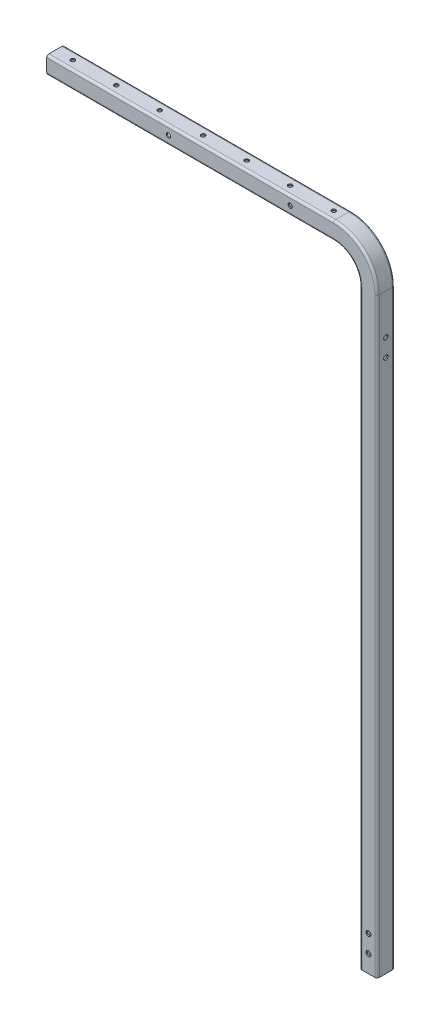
ISO-10303-21;
HEADER;
FILE_DESCRIPTION(('STEP AP214'),'2;1');
FILE_NAME('part.step','',(''),(''),'','','');
FILE_SCHEMA(('AUTOMOTIVE_DESIGN { 1 0 10303 214 1 1 1 1 }'));
ENDSEC;
DATA;
#1=APPLICATION_CONTEXT('core data for automotive mechanical design processes');
#2=APPLICATION_PROTOCOL_DEFINITION('international standard','automotive_design',2000,#1);
#3=PRODUCT_CONTEXT('',#1,'mechanical');
#4=PRODUCT('Part','Part','',(#3));
#5=PRODUCT_RELATED_PRODUCT_CATEGORY('part','',(#4));
#6=PRODUCT_DEFINITION_FORMATION('','',#4);
#7=PRODUCT_DEFINITION_CONTEXT('part definition',#1,'design');
#8=PRODUCT_DEFINITION('design','',#6,#7);
#9=PRODUCT_DEFINITION_SHAPE('','',#8);
#10=(LENGTH_UNIT() NAMED_UNIT(*) SI_UNIT(.MILLI.,.METRE.));
#11=(NAMED_UNIT(*) PLANE_ANGLE_UNIT() SI_UNIT($,.RADIAN.));
#12=(NAMED_UNIT(*) SI_UNIT($,.STERADIAN.) SOLID_ANGLE_UNIT());
#13=UNCERTAINTY_MEASURE_WITH_UNIT(LENGTH_MEASURE(1.E-05),#10,'distance_accuracy_value','');
#14=(GEOMETRIC_REPRESENTATION_CONTEXT(3) GLOBAL_UNCERTAINTY_ASSIGNED_CONTEXT((#13)) GLOBAL_UNIT_ASSIGNED_CONTEXT((#10,
#11,#12)) REPRESENTATION_CONTEXT('',''));
#15=CARTESIAN_POINT('',(0.,0.,0.));
#16=DIRECTION('',(0.,0.,1.));
#17=DIRECTION('',(1.,0.,0.));
#18=AXIS2_PLACEMENT_3D('',#15,#16,#17);
#19=CARTESIAN_POINT('',(25.4,12.7,0.));
#20=DIRECTION('',(0.,1.,0.));
#21=DIRECTION('',(0.,0.,1.));
#22=AXIS2_PLACEMENT_3D('',#19,#20,#21);
#23=CYLINDRICAL_SURFACE('',#22,2.99999999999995);
#24=CARTESIAN_POINT('',(25.4,-12.7,0.));
#25=DIRECTION('',(0.,-1.,0.));
#26=DIRECTION('',(0.,0.,-1.));
#27=AXIS2_PLACEMENT_3D('',#24,#25,#26);
#28=CIRCLE('',#27,2.99999999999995);
#29=CARTESIAN_POINT('',(25.4,-12.7,-2.99999999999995));
#30=VERTEX_POINT('',#29);
#31=EDGE_CURVE('E46',#30,#30,#28,.T.);
#32=ORIENTED_EDGE('',*,*,#31,.T.);
#33=EDGE_LOOP('',(#32));
#34=FACE_BOUND('',#33,.T.);
#35=CARTESIAN_POINT('',(25.4,-11.1125,0.));
#36=DIRECTION('',(0.,-1.,0.));
#37=DIRECTION('',(0.,0.,-1.));
#38=AXIS2_PLACEMENT_3D('',#35,#36,#37);
#39=CIRCLE('',#38,2.99999999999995);
#40=CARTESIAN_POINT('',(25.4,-11.1125,-2.99999999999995));
#41=VERTEX_POINT('',#40);
#42=EDGE_CURVE('E11',#41,#41,#39,.T.);
#43=ORIENTED_EDGE('',*,*,#42,.F.);
#44=EDGE_LOOP('',(#43));
#45=FACE_BOUND('',#44,.T.);
#46=ADVANCED_FACE('F38',(#34,#45),#23,.F.);
#47=CARTESIAN_POINT('',(88.9,12.7,0.));
#48=DIRECTION('',(0.,1.,0.));
#49=DIRECTION('',(0.,0.,1.));
#50=AXIS2_PLACEMENT_3D('',#47,#48,#49);
#51=CYLINDRICAL_SURFACE('',#50,2.99999999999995);
#52=CARTESIAN_POINT('',(88.9,-12.7,0.));
#53=DIRECTION('',(0.,-1.,0.));
#54=DIRECTION('',(0.,0.,-1.));
#55=AXIS2_PLACEMENT_3D('',#52,#53,#54);
#56=CIRCLE('',#55,2.99999999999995);
#57=CARTESIAN_POINT('',(88.9,-12.7,-2.99999999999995));
#58=VERTEX_POINT('',#57);
#59=EDGE_CURVE('E579',#58,#58,#56,.T.);
#60=ORIENTED_EDGE('',*,*,#59,.T.);
#61=EDGE_LOOP('',(#60));
#62=FACE_BOUND('',#61,.T.);
#63=CARTESIAN_POINT('',(88.9,-11.1125,0.));
#64=DIRECTION('',(0.,-1.,0.));
#65=DIRECTION('',(0.,0.,-1.));
#66=AXIS2_PLACEMENT_3D('',#63,#64,#65);
#67=CIRCLE('',#66,2.99999999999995);
#68=CARTESIAN_POINT('',(88.9,-11.1125,-2.99999999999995));
#69=VERTEX_POINT('',#68);
#70=EDGE_CURVE('E582',#69,#69,#67,.T.);
#71=ORIENTED_EDGE('',*,*,#70,.F.);
#72=EDGE_LOOP('',(#71));
#73=FACE_BOUND('',#72,.T.);
#74=ADVANCED_FACE('F796',(#62,#73),#51,.F.);
#75=CARTESIAN_POINT('',(152.4,12.7,0.));
#76=DIRECTION('',(0.,1.,0.));
#77=DIRECTION('',(0.,0.,1.));
#78=AXIS2_PLACEMENT_3D('',#75,#76,#77);
#79=CYLINDRICAL_SURFACE('',#78,2.99999999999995);
#80=CARTESIAN_POINT('',(152.4,-12.7,0.));
#81=DIRECTION('',(0.,-1.,0.));
#82=DIRECTION('',(0.,0.,-1.));
#83=AXIS2_PLACEMENT_3D('',#80,#81,#82);
#84=CIRCLE('',#83,2.99999999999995);
#85=CARTESIAN_POINT('',(152.4,-12.7,-2.99999999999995));
#86=VERTEX_POINT('',#85);
#87=EDGE_CURVE('E573',#86,#86,#84,.T.);
#88=ORIENTED_EDGE('',*,*,#87,.T.);
#89=EDGE_LOOP('',(#88));
#90=FACE_BOUND('',#89,.T.);
#91=CARTESIAN_POINT('',(152.4,-11.1125,0.));
#92=DIRECTION('',(0.,-1.,0.));
#93=DIRECTION('',(0.,0.,-1.));
#94=AXIS2_PLACEMENT_3D('',#91,#92,#93);
#95=CIRCLE('',#94,2.99999999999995);
#96=CARTESIAN_POINT('',(152.4,-11.1125,-2.99999999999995));
#97=VERTEX_POINT('',#96);
#98=EDGE_CURVE('E576',#97,#97,#95,.T.);
#99=ORIENTED_EDGE('',*,*,#98,.F.);
#100=EDGE_LOOP('',(#99));
#101=FACE_BOUND('',#100,.T.);
#102=ADVANCED_FACE('F801',(#90,#101),#79,.F.);
#103=CARTESIAN_POINT('',(215.9,12.7,0.));
#104=DIRECTION('',(0.,1.,0.));
#105=DIRECTION('',(0.,0.,1.));
#106=AXIS2_PLACEMENT_3D('',#103,#104,#105);
#107=CYLINDRICAL_SURFACE('',#106,2.99999999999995);
#108=CARTESIAN_POINT('',(215.9,-12.7,0.));
#109=DIRECTION('',(0.,-1.,0.));
#110=DIRECTION('',(0.,0.,-1.));
#111=AXIS2_PLACEMENT_3D('',#108,#109,#110);
#112=CIRCLE('',#111,2.99999999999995);
#113=CARTESIAN_POINT('',(215.9,-12.7,-2.99999999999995));
#114=VERTEX_POINT('',#113);
#115=EDGE_CURVE('E567',#114,#114,#112,.T.);
#116=ORIENTED_EDGE('',*,*,#115,.T.);
#117=EDGE_LOOP('',(#116));
#118=FACE_BOUND('',#117,.T.);
#119=CARTESIAN_POINT('',(215.9,-11.1125,0.));
#120=DIRECTION('',(0.,-1.,0.));
#121=DIRECTION('',(0.,0.,-1.));
#122=AXIS2_PLACEMENT_3D('',#119,#120,#121);
#123=CIRCLE('',#122,2.99999999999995);
#124=CARTESIAN_POINT('',(215.9,-11.1125,-2.99999999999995));
#125=VERTEX_POINT('',#124);
#126=EDGE_CURVE('E570',#125,#125,#123,.T.);
#127=ORIENTED_EDGE('',*,*,#126,.F.);
#128=EDGE_LOOP('',(#127));
#129=FACE_BOUND('',#128,.T.);
#130=ADVANCED_FACE('F962',(#118,#129),#107,.F.);
#131=CARTESIAN_POINT('',(279.4,12.7,0.));
#132=DIRECTION('',(0.,1.,0.));
#133=DIRECTION('',(0.,0.,1.));
#134=AXIS2_PLACEMENT_3D('',#131,#132,#133);
#135=CYLINDRICAL_SURFACE('',#134,2.99999999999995);
#136=CARTESIAN_POINT('',(279.4,-12.7,0.));
#137=DIRECTION('',(0.,-1.,0.));
#138=DIRECTION('',(0.,0.,-1.));
#139=AXIS2_PLACEMENT_3D('',#136,#137,#138);
#140=CIRCLE('',#139,2.99999999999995);
#141=CARTESIAN_POINT('',(279.4,-12.7,-2.99999999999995));
#142=VERTEX_POINT('',#141);
#143=EDGE_CURVE('E561',#142,#142,#140,.T.);
#144=ORIENTED_EDGE('',*,*,#143,.T.);
#145=EDGE_LOOP('',(#144));
#146=FACE_BOUND('',#145,.T.);
#147=CARTESIAN_POINT('',(279.4,-11.1125,0.));
#148=DIRECTION('',(0.,-1.,0.));
#149=DIRECTION('',(0.,0.,-1.));
#150=AXIS2_PLACEMENT_3D('',#147,#148,#149);
#151=CIRCLE('',#150,2.99999999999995);
#152=CARTESIAN_POINT('',(279.4,-11.1125,-2.99999999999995));
#153=VERTEX_POINT('',#152);
#154=EDGE_CURVE('E564',#153,#153,#151,.T.);
#155=ORIENTED_EDGE('',*,*,#154,.F.);
#156=EDGE_LOOP('',(#155));
#157=FACE_BOUND('',#156,.T.);
#158=ADVANCED_FACE('F958',(#146,#157),#135,.F.);
#159=CARTESIAN_POINT('',(25.4,12.7,0.));
#160=DIRECTION('',(0.,1.,0.));
#161=DIRECTION('',(0.,0.,1.));
#162=AXIS2_PLACEMENT_3D('',#159,#160,#161);
#163=CYLINDRICAL_SURFACE('',#162,2.99999999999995);
#164=CARTESIAN_POINT('',(25.4,12.7,0.));
#165=DIRECTION('',(0.,1.,0.));
#166=DIRECTION('',(0.,0.,1.));
#167=AXIS2_PLACEMENT_3D('',#164,#165,#166);
#168=CIRCLE('',#167,3.);
#169=CARTESIAN_POINT('',(25.4,12.7,3.));
#170=VERTEX_POINT('',#169);
#171=EDGE_CURVE('E555',#170,#170,#168,.T.);
#172=ORIENTED_EDGE('',*,*,#171,.T.);
#173=EDGE_LOOP('',(#172));
#174=FACE_BOUND('',#173,.T.);
#175=CARTESIAN_POINT('',(25.4,11.1125,0.));
#176=DIRECTION('',(0.,1.,0.));
#177=DIRECTION('',(0.,0.,1.));
#178=AXIS2_PLACEMENT_3D('',#175,#176,#177);
#179=CIRCLE('',#178,2.99999999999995);
#180=CARTESIAN_POINT('',(25.4,11.1125,2.99999999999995));
#181=VERTEX_POINT('',#180);
#182=EDGE_CURVE('E558',#181,#181,#179,.T.);
#183=ORIENTED_EDGE('',*,*,#182,.F.);
#184=EDGE_LOOP('',(#183));
#185=FACE_BOUND('',#184,.T.);
#186=ADVANCED_FACE('F954',(#174,#185),#163,.F.);
#187=CARTESIAN_POINT('',(88.9,12.7,0.));
#188=DIRECTION('',(0.,1.,0.));
#189=DIRECTION('',(0.,0.,1.));
#190=AXIS2_PLACEMENT_3D('',#187,#188,#189);
#191=CYLINDRICAL_SURFACE('',#190,2.99999999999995);
#192=CARTESIAN_POINT('',(88.9,12.7,0.));
#193=DIRECTION('',(0.,1.,0.));
#194=DIRECTION('',(0.,0.,1.));
#195=AXIS2_PLACEMENT_3D('',#192,#193,#194);
#196=CIRCLE('',#195,3.);
#197=CARTESIAN_POINT('',(88.9,12.7,3.));
#198=VERTEX_POINT('',#197);
#199=EDGE_CURVE('E549',#198,#198,#196,.T.);
#200=ORIENTED_EDGE('',*,*,#199,.T.);
#201=EDGE_LOOP('',(#200));
#202=FACE_BOUND('',#201,.T.);
#203=CARTESIAN_POINT('',(88.9,11.1125,0.));
#204=DIRECTION('',(0.,1.,0.));
#205=DIRECTION('',(0.,0.,1.));
#206=AXIS2_PLACEMENT_3D('',#203,#204,#205);
#207=CIRCLE('',#206,2.99999999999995);
#208=CARTESIAN_POINT('',(88.9,11.1125,2.99999999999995));
#209=VERTEX_POINT('',#208);
#210=EDGE_CURVE('E552',#209,#209,#207,.T.);
#211=ORIENTED_EDGE('',*,*,#210,.F.);
#212=EDGE_LOOP('',(#211));
#213=FACE_BOUND('',#212,.T.);
#214=ADVANCED_FACE('F950',(#202,#213),#191,.F.);
#215=CARTESIAN_POINT('',(152.4,12.7,0.));
#216=DIRECTION('',(0.,1.,0.));
#217=DIRECTION('',(0.,0.,1.));
#218=AXIS2_PLACEMENT_3D('',#215,#216,#217);
#219=CYLINDRICAL_SURFACE('',#218,2.99999999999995);
#220=CARTESIAN_POINT('',(152.4,12.7,0.));
#221=DIRECTION('',(0.,1.,0.));
#222=DIRECTION('',(0.,0.,1.));
#223=AXIS2_PLACEMENT_3D('',#220,#221,#222);
#224=CIRCLE('',#223,3.);
#225=CARTESIAN_POINT('',(152.4,12.7,3.));
#226=VERTEX_POINT('',#225);
#227=EDGE_CURVE('E543',#226,#226,#224,.T.);
#228=ORIENTED_EDGE('',*,*,#227,.T.);
#229=EDGE_LOOP('',(#228));
#230=FACE_BOUND('',#229,.T.);
#231=CARTESIAN_POINT('',(152.4,11.1125,0.));
#232=DIRECTION('',(0.,1.,0.));
#233=DIRECTION('',(0.,0.,1.));
#234=AXIS2_PLACEMENT_3D('',#231,#232,#233);
#235=CIRCLE('',#234,2.99999999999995);
#236=CARTESIAN_POINT('',(152.4,11.1125,2.99999999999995));
#237=VERTEX_POINT('',#236);
#238=EDGE_CURVE('E546',#237,#237,#235,.T.);
#239=ORIENTED_EDGE('',*,*,#238,.F.);
#240=EDGE_LOOP('',(#239));
#241=FACE_BOUND('',#240,.T.);
#242=ADVANCED_FACE('F946',(#230,#241),#219,.F.);
#243=CARTESIAN_POINT('',(215.9,12.7,0.));
#244=DIRECTION('',(0.,1.,0.));
#245=DIRECTION('',(0.,0.,1.));
#246=AXIS2_PLACEMENT_3D('',#243,#244,#245);
#247=CYLINDRICAL_SURFACE('',#246,2.99999999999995);
#248=CARTESIAN_POINT('',(215.9,12.7,0.));
#249=DIRECTION('',(0.,1.,0.));
#250=DIRECTION('',(0.,0.,1.));
#251=AXIS2_PLACEMENT_3D('',#248,#249,#250);
#252=CIRCLE('',#251,3.);
#253=CARTESIAN_POINT('',(215.9,12.7,3.));
#254=VERTEX_POINT('',#253);
#255=EDGE_CURVE('E537',#254,#254,#252,.T.);
#256=ORIENTED_EDGE('',*,*,#255,.T.);
#257=EDGE_LOOP('',(#256));
#258=FACE_BOUND('',#257,.T.);
#259=CARTESIAN_POINT('',(215.9,11.1125,0.));
#260=DIRECTION('',(0.,1.,0.));
#261=DIRECTION('',(0.,0.,1.));
#262=AXIS2_PLACEMENT_3D('',#259,#260,#261);
#263=CIRCLE('',#262,2.99999999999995);
#264=CARTESIAN_POINT('',(215.9,11.1125,2.99999999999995));
#265=VERTEX_POINT('',#264);
#266=EDGE_CURVE('E540',#265,#265,#263,.T.);
#267=ORIENTED_EDGE('',*,*,#266,.F.);
#268=EDGE_LOOP('',(#267));
#269=FACE_BOUND('',#268,.T.);
#270=ADVANCED_FACE('F942',(#258,#269),#247,.F.);
#271=CARTESIAN_POINT('',(279.4,12.7,0.));
#272=DIRECTION('',(0.,1.,0.));
#273=DIRECTION('',(0.,0.,1.));
#274=AXIS2_PLACEMENT_3D('',#271,#272,#273);
#275=CYLINDRICAL_SURFACE('',#274,2.99999999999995);
#276=CARTESIAN_POINT('',(279.4,12.7,0.));
#277=DIRECTION('',(0.,1.,0.));
#278=DIRECTION('',(0.,0.,1.));
#279=AXIS2_PLACEMENT_3D('',#276,#277,#278);
#280=CIRCLE('',#279,3.);
#281=CARTESIAN_POINT('',(279.4,12.7,3.));
#282=VERTEX_POINT('',#281);
#283=EDGE_CURVE('E501',#282,#282,#280,.T.);
#284=ORIENTED_EDGE('',*,*,#283,.T.);
#285=EDGE_LOOP('',(#284));
#286=FACE_BOUND('',#285,.T.);
#287=CARTESIAN_POINT('',(279.4,11.1125,0.));
#288=DIRECTION('',(0.,1.,0.));
#289=DIRECTION('',(0.,0.,1.));
#290=AXIS2_PLACEMENT_3D('',#287,#288,#289);
#291=CIRCLE('',#290,2.99999999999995);
#292=CARTESIAN_POINT('',(279.4,11.1125,2.99999999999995));
#293=VERTEX_POINT('',#292);
#294=EDGE_CURVE('E534',#293,#293,#291,.T.);
#295=ORIENTED_EDGE('',*,*,#294,.F.);
#296=EDGE_LOOP('',(#295));
#297=FACE_BOUND('',#296,.T.);
#298=ADVANCED_FACE('F857',(#286,#297),#275,.F.);
#299=CARTESIAN_POINT('',(482.6,-914.4,12.7));
#300=DIRECTION('',(0.,-1.,0.));
#301=DIRECTION('',(0.,0.,-1.));
#302=AXIS2_PLACEMENT_3D('',#299,#300,#301);
#303=PLANE('',#302);
#304=DIRECTION('',(0.,0.,-1.));
#305=VECTOR('',#304,1.);
#306=CARTESIAN_POINT('',(482.6,-914.4,12.7));
#307=LINE('',#306,#305);
#308=CARTESIAN_POINT('',(482.6,-914.4,9.525));
#309=VERTEX_POINT('',#308);
#310=CARTESIAN_POINT('',(482.6,-914.4,-9.52499999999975));
#311=VERTEX_POINT('',#310);
#312=EDGE_CURVE('E393',#309,#311,#307,.T.);
#313=ORIENTED_EDGE('',*,*,#312,.F.);
#314=CARTESIAN_POINT('',(479.425,-914.4,9.525));
#315=DIRECTION('',(0.,-1.,0.));
#316=DIRECTION('',(1.,0.,0.));
#317=AXIS2_PLACEMENT_3D('',#314,#315,#316);
#318=CIRCLE('',#317,3.175);
#319=CARTESIAN_POINT('',(479.425,-914.4,12.7));
#320=VERTEX_POINT('',#319);
#321=EDGE_CURVE('E421',#309,#320,#318,.T.);
#322=ORIENTED_EDGE('',*,*,#321,.T.);
#323=DIRECTION('',(-1.,0.,0.));
#324=VECTOR('',#323,1.);
#325=CARTESIAN_POINT('',(482.6,-914.4,12.7));
#326=LINE('',#325,#324);
#327=CARTESIAN_POINT('',(460.375,-914.4,12.7));
#328=VERTEX_POINT('',#327);
#329=EDGE_CURVE('E389',#320,#328,#326,.T.);
#330=ORIENTED_EDGE('',*,*,#329,.T.);
#331=CARTESIAN_POINT('',(460.375,-914.4,9.525));
#332=DIRECTION('',(0.,-1.,0.));
#333=DIRECTION('',(1.,0.,0.));
#334=AXIS2_PLACEMENT_3D('',#331,#332,#333);
#335=CIRCLE('',#334,3.175);
#336=CARTESIAN_POINT('',(457.2,-914.4,9.525));
#337=VERTEX_POINT('',#336);
#338=EDGE_CURVE('E412',#328,#337,#335,.T.);
#339=ORIENTED_EDGE('',*,*,#338,.T.);
#340=DIRECTION('',(0.,0.,1.));
#341=VECTOR('',#340,1.);
#342=CARTESIAN_POINT('',(457.2,-914.4,-12.7));
#343=LINE('',#342,#341);
#344=CARTESIAN_POINT('',(457.2,-914.4,-9.52499999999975));
#345=VERTEX_POINT('',#344);
#346=EDGE_CURVE('E401',#345,#337,#343,.T.);
#347=ORIENTED_EDGE('',*,*,#346,.F.);
#348=CARTESIAN_POINT('',(460.375,-914.4,-9.52499999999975));
#349=DIRECTION('',(0.,-1.,0.));
#350=DIRECTION('',(1.,0.,0.));
#351=AXIS2_PLACEMENT_3D('',#348,#349,#350);
#352=CIRCLE('',#351,3.175);
#353=CARTESIAN_POINT('',(460.375,-914.4,-12.7));
#354=VERTEX_POINT('',#353);
#355=EDGE_CURVE('E415',#345,#354,#352,.T.);
#356=ORIENTED_EDGE('',*,*,#355,.T.);
#357=DIRECTION('',(1.,0.,0.));
#358=VECTOR('',#357,1.);
#359=CARTESIAN_POINT('',(457.2,-914.4,-12.7));
#360=LINE('',#359,#358);
#361=CARTESIAN_POINT('',(479.425,-914.4,-12.7));
#362=VERTEX_POINT('',#361);
#363=EDGE_CURVE('E397',#354,#362,#360,.T.);
#364=ORIENTED_EDGE('',*,*,#363,.T.);
#365=CARTESIAN_POINT('',(479.425,-914.4,-9.52499999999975));
#366=DIRECTION('',(0.,-1.,0.));
#367=DIRECTION('',(1.,0.,0.));
#368=AXIS2_PLACEMENT_3D('',#365,#366,#367);
#369=CIRCLE('',#368,3.175);
#370=EDGE_CURVE('E418',#362,#311,#369,.T.);
#371=ORIENTED_EDGE('',*,*,#370,.T.);
#372=EDGE_LOOP('',(#313,#322,#330,#339,#347,#356,#364,#371));
#373=FACE_BOUND('',#372,.T.);
#374=CARTESIAN_POINT('',(479.425,-914.4,9.525));
#375=DIRECTION('',(0.,-1.,0.));
#376=DIRECTION('',(1.,0.,0.));
#377=AXIS2_PLACEMENT_3D('',#374,#375,#376);
#378=CIRCLE('',#377,1.5875);
#379=CARTESIAN_POINT('',(481.0125,-914.4,9.525));
#380=VERTEX_POINT('',#379);
#381=CARTESIAN_POINT('',(479.425,-914.4,11.1125));
#382=VERTEX_POINT('',#381);
#383=EDGE_CURVE('E320',#380,#382,#378,.T.);
#384=ORIENTED_EDGE('',*,*,#383,.F.);
#385=DIRECTION('',(0.,0.,-1.));
#386=VECTOR('',#385,1.);
#387=CARTESIAN_POINT('',(481.0125,-914.4,12.7));
#388=LINE('',#387,#386);
#389=CARTESIAN_POINT('',(481.0125,-914.4,-9.52499999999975));
#390=VERTEX_POINT('',#389);
#391=EDGE_CURVE('E317',#380,#390,#388,.T.);
#392=ORIENTED_EDGE('',*,*,#391,.T.);
#393=CARTESIAN_POINT('',(479.425,-914.4,-9.52499999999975));
#394=DIRECTION('',(0.,-1.,0.));
#395=DIRECTION('',(1.,0.,0.));
#396=AXIS2_PLACEMENT_3D('',#393,#394,#395);
#397=CIRCLE('',#396,1.5875);
#398=CARTESIAN_POINT('',(479.425,-914.4,-11.1124999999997));
#399=VERTEX_POINT('',#398);
#400=EDGE_CURVE('E314',#399,#390,#397,.T.);
#401=ORIENTED_EDGE('',*,*,#400,.F.);
#402=DIRECTION('',(1.,0.,0.));
#403=VECTOR('',#402,1.);
#404=CARTESIAN_POINT('',(419.1,-914.4,-11.1124999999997));
#405=LINE('',#404,#403);
#406=CARTESIAN_POINT('',(460.375,-914.4,-11.1124999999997));
#407=VERTEX_POINT('',#406);
#408=EDGE_CURVE('E54',#407,#399,#405,.T.);
#409=ORIENTED_EDGE('',*,*,#408,.F.);
#410=CARTESIAN_POINT('',(460.375,-914.4,-9.52499999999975));
#411=DIRECTION('',(0.,-1.,0.));
#412=DIRECTION('',(1.,0.,0.));
#413=AXIS2_PLACEMENT_3D('',#410,#411,#412);
#414=CIRCLE('',#413,1.5875);
#415=CARTESIAN_POINT('',(458.7875,-914.4,-9.52499999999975));
#416=VERTEX_POINT('',#415);
#417=EDGE_CURVE('E311',#416,#407,#414,.T.);
#418=ORIENTED_EDGE('',*,*,#417,.F.);
#419=DIRECTION('',(0.,0.,1.));
#420=VECTOR('',#419,1.);
#421=CARTESIAN_POINT('',(458.7875,-914.4,12.7));
#422=LINE('',#421,#420);
#423=CARTESIAN_POINT('',(458.7875,-914.4,9.525));
#424=VERTEX_POINT('',#423);
#425=EDGE_CURVE('E307',#416,#424,#422,.T.);
#426=ORIENTED_EDGE('',*,*,#425,.T.);
#427=CARTESIAN_POINT('',(460.375,-914.4,9.525));
#428=DIRECTION('',(0.,-1.,0.));
#429=DIRECTION('',(1.,0.,0.));
#430=AXIS2_PLACEMENT_3D('',#427,#428,#429);
#431=CIRCLE('',#430,1.5875);
#432=CARTESIAN_POINT('',(460.375,-914.4,11.1125));
#433=VERTEX_POINT('',#432);
#434=EDGE_CURVE('E259',#433,#424,#431,.T.);
#435=ORIENTED_EDGE('',*,*,#434,.F.);
#436=DIRECTION('',(-1.,0.,0.));
#437=VECTOR('',#436,1.);
#438=CARTESIAN_POINT('',(419.1,-914.4,11.1125));
#439=LINE('',#438,#437);
#440=EDGE_CURVE('E276',#382,#433,#439,.T.);
#441=ORIENTED_EDGE('',*,*,#440,.F.);
#442=EDGE_LOOP('',(#384,#392,#401,#409,#418,#426,#435,#441));
#443=FACE_BOUND('',#442,.T.);
#444=ADVANCED_FACE('F766',(#373,#443),#303,.T.);
#445=CARTESIAN_POINT('',(457.2,-50.8,-12.7));
#446=DIRECTION('',(1.,0.,0.));
#447=DIRECTION('',(0.,1.,0.));
#448=AXIS2_PLACEMENT_3D('',#445,#446,#447);
#449=PLANE('',#448);
#450=CARTESIAN_POINT('',(457.2,-134.9375,0.));
#451=DIRECTION('',(1.,0.,0.));
#452=DIRECTION('',(0.,1.,0.));
#453=AXIS2_PLACEMENT_3D('',#450,#451,#452);
#454=CIRCLE('',#453,3.17499999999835);
#455=CARTESIAN_POINT('',(457.2,-131.762500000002,0.));
#456=VERTEX_POINT('',#455);
#457=EDGE_CURVE('E630',#456,#456,#454,.T.);
#458=ORIENTED_EDGE('',*,*,#457,.T.);
#459=EDGE_LOOP('',(#458));
#460=FACE_BOUND('',#459,.T.);
#461=CARTESIAN_POINT('',(457.2,-109.5375,0.));
#462=DIRECTION('',(1.,0.,0.));
#463=DIRECTION('',(0.,1.,0.));
#464=AXIS2_PLACEMENT_3D('',#461,#462,#463);
#465=CIRCLE('',#464,3.17499999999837);
#466=CARTESIAN_POINT('',(457.2,-106.362500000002,0.));
#467=VERTEX_POINT('',#466);
#468=EDGE_CURVE('E637',#467,#467,#465,.T.);
#469=ORIENTED_EDGE('',*,*,#468,.T.);
#470=EDGE_LOOP('',(#469));
#471=FACE_BOUND('',#470,.T.);
#472=DIRECTION('',(0.,0.,1.));
#473=VECTOR('',#472,1.);
#474=CARTESIAN_POINT('',(457.2,-50.8,-12.7));
#475=LINE('',#474,#473);
#476=CARTESIAN_POINT('',(457.2,-50.8,-9.52499999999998));
#477=VERTEX_POINT('',#476);
#478=CARTESIAN_POINT('',(457.2,-50.8,9.525));
#479=VERTEX_POINT('',#478);
#480=EDGE_CURVE('E385',#477,#479,#475,.T.);
#481=ORIENTED_EDGE('',*,*,#480,.F.);
#482=DIRECTION('',(0.,-1.,0.));
#483=VECTOR('',#482,1.);
#484=CARTESIAN_POINT('',(457.2,-50.8,-9.52499999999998));
#485=LINE('',#484,#483);
#486=EDGE_CURVE('E465',#477,#345,#485,.T.);
#487=ORIENTED_EDGE('',*,*,#486,.T.);
#488=ORIENTED_EDGE('',*,*,#346,.T.);
#489=DIRECTION('',(0.,-1.,0.));
#490=VECTOR('',#489,1.);
#491=CARTESIAN_POINT('',(457.2,-50.8,9.525));
#492=LINE('',#491,#490);
#493=EDGE_CURVE('E462',#337,#479,#492,.F.);
#494=ORIENTED_EDGE('',*,*,#493,.T.);
#495=EDGE_LOOP('',(#481,#487,#488,#494));
#496=FACE_BOUND('',#495,.T.);
#497=ADVANCED_FACE('F856',(#460,#471,#496),#449,.F.);
#498=CARTESIAN_POINT('',(482.6,-50.8,12.7));
#499=DIRECTION('',(-1.,0.,0.));
#500=DIRECTION('',(0.,-1.,0.));
#501=AXIS2_PLACEMENT_3D('',#498,#499,#500);
#502=PLANE('',#501);
#503=CARTESIAN_POINT('',(482.6,-134.9375,0.));
#504=DIRECTION('',(1.,0.,0.));
#505=DIRECTION('',(0.,1.,0.));
#506=AXIS2_PLACEMENT_3D('',#503,#504,#505);
#507=CIRCLE('',#506,3.17499999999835);
#508=CARTESIAN_POINT('',(482.6,-131.762500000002,0.));
#509=VERTEX_POINT('',#508);
#510=EDGE_CURVE('E595',#509,#509,#507,.T.);
#511=ORIENTED_EDGE('',*,*,#510,.F.);
#512=EDGE_LOOP('',(#511));
#513=FACE_BOUND('',#512,.T.);
#514=CARTESIAN_POINT('',(482.6,-109.5375,0.));
#515=DIRECTION('',(1.,0.,0.));
#516=DIRECTION('',(0.,1.,0.));
#517=AXIS2_PLACEMENT_3D('',#514,#515,#516);
#518=CIRCLE('',#517,3.17499999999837);
#519=CARTESIAN_POINT('',(482.6,-106.362500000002,0.));
#520=VERTEX_POINT('',#519);
#521=EDGE_CURVE('E591',#520,#520,#518,.T.);
#522=ORIENTED_EDGE('',*,*,#521,.F.);
#523=EDGE_LOOP('',(#522));
#524=FACE_BOUND('',#523,.T.);
#525=DIRECTION('',(0.,0.,-1.));
#526=VECTOR('',#525,1.);
#527=CARTESIAN_POINT('',(482.6,-50.8,12.7));
#528=LINE('',#527,#526);
#529=CARTESIAN_POINT('',(482.6,-50.8,9.525));
#530=VERTEX_POINT('',#529);
#531=CARTESIAN_POINT('',(482.6,-50.8,-9.52499999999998));
#532=VERTEX_POINT('',#531);
#533=EDGE_CURVE('E365',#530,#532,#528,.T.);
#534=ORIENTED_EDGE('',*,*,#533,.F.);
#535=DIRECTION('',(0.,-1.,0.));
#536=VECTOR('',#535,1.);
#537=CARTESIAN_POINT('',(482.6,-50.8,9.525));
#538=LINE('',#537,#536);
#539=EDGE_CURVE('E408',#530,#309,#538,.T.);
#540=ORIENTED_EDGE('',*,*,#539,.T.);
#541=ORIENTED_EDGE('',*,*,#312,.T.);
#542=DIRECTION('',(0.,-1.,0.));
#543=VECTOR('',#542,1.);
#544=CARTESIAN_POINT('',(482.6,-50.8,-9.52499999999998));
#545=LINE('',#544,#543);
#546=EDGE_CURVE('E405',#311,#532,#545,.F.);
#547=ORIENTED_EDGE('',*,*,#546,.T.);
#548=EDGE_LOOP('',(#534,#540,#541,#547));
#549=FACE_BOUND('',#548,.T.);
#550=ADVANCED_FACE('F885',(#513,#524,#549),#502,.F.);
#551=CARTESIAN_POINT('',(419.1,-50.8,0.));
#552=DIRECTION('',(0.,0.,-1.));
#553=DIRECTION('',(-1.,0.,0.));
#554=AXIS2_PLACEMENT_3D('',#551,#552,#553);
#555=CYLINDRICAL_SURFACE('',#554,38.1);
#556=DIRECTION('',(0.,0.,1.));
#557=VECTOR('',#556,1.);
#558=CARTESIAN_POINT('',(419.1,-12.7,-12.7));
#559=LINE('',#558,#557);
#560=CARTESIAN_POINT('',(419.1,-12.7,-9.525));
#561=VERTEX_POINT('',#560);
#562=CARTESIAN_POINT('',(419.1,-12.7,9.525));
#563=VERTEX_POINT('',#562);
#564=EDGE_CURVE('E356',#561,#563,#559,.T.);
#565=ORIENTED_EDGE('',*,*,#564,.F.);
#566=CARTESIAN_POINT('',(419.1,-50.8,-9.52499999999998));
#567=DIRECTION('',(0.,0.,1.));
#568=DIRECTION('',(0.,-1.,0.));
#569=AXIS2_PLACEMENT_3D('',#566,#567,#568);
#570=CIRCLE('',#569,38.1);
#571=EDGE_CURVE('E478',#561,#477,#570,.F.);
#572=ORIENTED_EDGE('',*,*,#571,.T.);
#573=ORIENTED_EDGE('',*,*,#480,.T.);
#574=CARTESIAN_POINT('',(419.1,-50.8,9.525));
#575=DIRECTION('',(0.,0.,-1.));
#576=DIRECTION('',(-1.,0.,0.));
#577=AXIS2_PLACEMENT_3D('',#574,#575,#576);
#578=CIRCLE('',#577,38.1);
#579=EDGE_CURVE('E475',#479,#563,#578,.F.);
#580=ORIENTED_EDGE('',*,*,#579,.T.);
#581=EDGE_LOOP('',(#565,#572,#573,#580));
#582=FACE_BOUND('',#581,.T.);
#583=ADVANCED_FACE('F881',(#582),#555,.F.);
#584=CARTESIAN_POINT('',(419.1,-50.8,0.));
#585=DIRECTION('',(0.,0.,-1.));
#586=DIRECTION('',(-1.,0.,0.));
#587=AXIS2_PLACEMENT_3D('',#584,#585,#586);
#588=CYLINDRICAL_SURFACE('',#587,63.5);
#589=DIRECTION('',(0.,0.,-1.));
#590=VECTOR('',#589,1.);
#591=CARTESIAN_POINT('',(419.1,12.7,12.7));
#592=LINE('',#591,#590);
#593=CARTESIAN_POINT('',(419.1,12.7,9.525));
#594=VERTEX_POINT('',#593);
#595=CARTESIAN_POINT('',(419.1,12.7,-9.525));
#596=VERTEX_POINT('',#595);
#597=EDGE_CURVE('E360',#594,#596,#592,.T.);
#598=ORIENTED_EDGE('',*,*,#597,.F.);
#599=CARTESIAN_POINT('',(419.1,-50.8,9.525));
#600=DIRECTION('',(0.,0.,-1.));
#601=DIRECTION('',(-1.,0.,0.));
#602=AXIS2_PLACEMENT_3D('',#599,#600,#601);
#603=CIRCLE('',#602,63.5);
#604=EDGE_CURVE('E472',#594,#530,#603,.T.);
#605=ORIENTED_EDGE('',*,*,#604,.T.);
#606=ORIENTED_EDGE('',*,*,#533,.T.);
#607=CARTESIAN_POINT('',(419.1,-50.8,-9.52499999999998));
#608=DIRECTION('',(0.,0.,1.));
#609=DIRECTION('',(0.,-1.,0.));
#610=AXIS2_PLACEMENT_3D('',#607,#608,#609);
#611=CIRCLE('',#610,63.5);
#612=EDGE_CURVE('E469',#532,#596,#611,.T.);
#613=ORIENTED_EDGE('',*,*,#612,.T.);
#614=EDGE_LOOP('',(#598,#605,#606,#613));
#615=FACE_BOUND('',#614,.T.);
#616=ADVANCED_FACE('F877',(#615),#588,.T.);
#617=CARTESIAN_POINT('',(419.1,12.7,12.7));
#618=DIRECTION('',(0.,0.,-1.));
#619=DIRECTION('',(-1.,0.,0.));
#620=AXIS2_PLACEMENT_3D('',#617,#618,#619);
#621=PLANE('',#620);
#622=CARTESIAN_POINT('',(469.9,-863.6,12.7000000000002));
#623=DIRECTION('',(0.,0.,-1.));
#624=DIRECTION('',(0.,1.,0.));
#625=AXIS2_PLACEMENT_3D('',#622,#623,#624);
#626=CIRCLE('',#625,3.57187499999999);
#627=CARTESIAN_POINT('',(469.9,-860.028125,12.7000000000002));
#628=VERTEX_POINT('',#627);
#629=EDGE_CURVE('E1605',#628,#628,#626,.T.);
#630=ORIENTED_EDGE('',*,*,#629,.T.);
#631=EDGE_LOOP('',(#630));
#632=FACE_BOUND('',#631,.T.);
#633=CARTESIAN_POINT('',(469.9,-889.,12.7000000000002));
#634=DIRECTION('',(0.,0.,-1.));
#635=DIRECTION('',(0.,1.,0.));
#636=AXIS2_PLACEMENT_3D('',#633,#634,#635);
#637=CIRCLE('',#636,3.57187499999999);
#638=CARTESIAN_POINT('',(469.9,-885.428125,12.7000000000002));
#639=VERTEX_POINT('',#638);
#640=EDGE_CURVE('E1599',#639,#639,#637,.T.);
#641=ORIENTED_EDGE('',*,*,#640,.T.);
#642=EDGE_LOOP('',(#641));
#643=FACE_BOUND('',#642,.T.);
#644=CARTESIAN_POINT('',(177.8,0.,12.7));
#645=DIRECTION('',(0.,0.,1.));
#646=DIRECTION('',(1.,0.,0.));
#647=AXIS2_PLACEMENT_3D('',#644,#645,#646);
#648=CIRCLE('',#647,3.17499999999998);
#649=CARTESIAN_POINT('',(180.975,0.,12.7));
#650=VERTEX_POINT('',#649);
#651=EDGE_CURVE('E599',#650,#650,#648,.T.);
#652=ORIENTED_EDGE('',*,*,#651,.F.);
#653=EDGE_LOOP('',(#652));
#654=FACE_BOUND('',#653,.T.);
#655=CARTESIAN_POINT('',(355.6,0.,12.7));
#656=DIRECTION('',(0.,0.,1.));
#657=DIRECTION('',(1.,0.,0.));
#658=AXIS2_PLACEMENT_3D('',#655,#656,#657);
#659=CIRCLE('',#658,3.17499999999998);
#660=CARTESIAN_POINT('',(358.775,0.,12.7));
#661=VERTEX_POINT('',#660);
#662=EDGE_CURVE('E617',#661,#661,#659,.T.);
#663=ORIENTED_EDGE('',*,*,#662,.F.);
#664=EDGE_LOOP('',(#663));
#665=FACE_BOUND('',#664,.T.);
#666=ORIENTED_EDGE('',*,*,#329,.F.);
#667=DIRECTION('',(0.,-1.,0.));
#668=VECTOR('',#667,1.);
#669=CARTESIAN_POINT('',(479.425,12.7,12.7));
#670=LINE('',#669,#668);
#671=CARTESIAN_POINT('',(479.425,-50.8,12.7));
#672=VERTEX_POINT('',#671);
#673=EDGE_CURVE('E440',#320,#672,#670,.F.);
#674=ORIENTED_EDGE('',*,*,#673,.T.);
#675=CARTESIAN_POINT('',(419.1,-50.8,12.7));
#676=DIRECTION('',(0.,0.,-1.));
#677=DIRECTION('',(-1.,0.,0.));
#678=AXIS2_PLACEMENT_3D('',#675,#676,#677);
#679=CIRCLE('',#678,60.325);
#680=CARTESIAN_POINT('',(419.1,9.52500000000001,12.7));
#681=VERTEX_POINT('',#680);
#682=EDGE_CURVE('E437',#672,#681,#679,.F.);
#683=ORIENTED_EDGE('',*,*,#682,.T.);
#684=DIRECTION('',(-1.,0.,0.));
#685=VECTOR('',#684,1.);
#686=CARTESIAN_POINT('',(0.,9.52500000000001,12.7));
#687=LINE('',#686,#685);
#688=CARTESIAN_POINT('',(0.,9.52500000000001,12.7));
#689=VERTEX_POINT('',#688);
#690=EDGE_CURVE('E434',#681,#689,#687,.T.);
#691=ORIENTED_EDGE('',*,*,#690,.T.);
#692=DIRECTION('',(0.,-1.,0.));
#693=VECTOR('',#692,1.);
#694=CARTESIAN_POINT('',(0.,12.7,12.7));
#695=LINE('',#694,#693);
#696=CARTESIAN_POINT('',(0.,-9.52499999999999,12.7));
#697=VERTEX_POINT('',#696);
#698=EDGE_CURVE('E366',#689,#697,#695,.T.);
#699=ORIENTED_EDGE('',*,*,#698,.T.);
#700=DIRECTION('',(-1.,0.,0.));
#701=VECTOR('',#700,1.);
#702=CARTESIAN_POINT('',(419.1,-9.52499999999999,12.7));
#703=LINE('',#702,#701);
#704=CARTESIAN_POINT('',(419.1,-9.52499999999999,12.7));
#705=VERTEX_POINT('',#704);
#706=EDGE_CURVE('E424',#697,#705,#703,.F.);
#707=ORIENTED_EDGE('',*,*,#706,.T.);
#708=CARTESIAN_POINT('',(419.1,-50.8,12.7));
#709=DIRECTION('',(0.,0.,-1.));
#710=DIRECTION('',(-1.,0.,0.));
#711=AXIS2_PLACEMENT_3D('',#708,#709,#710);
#712=CIRCLE('',#711,41.275);
#713=CARTESIAN_POINT('',(460.375,-50.8,12.7));
#714=VERTEX_POINT('',#713);
#715=EDGE_CURVE('E427',#705,#714,#712,.T.);
#716=ORIENTED_EDGE('',*,*,#715,.T.);
#717=DIRECTION('',(0.,-1.,0.));
#718=VECTOR('',#717,1.);
#719=CARTESIAN_POINT('',(460.375,12.7,12.7));
#720=LINE('',#719,#718);
#721=EDGE_CURVE('E430',#714,#328,#720,.T.);
#722=ORIENTED_EDGE('',*,*,#721,.T.);
#723=EDGE_LOOP('',(#666,#674,#683,#691,#699,#707,#716,#722));
#724=FACE_BOUND('',#723,.T.);
#725=ADVANCED_FACE('F873',(#632,#643,#654,#665,#724),#621,.F.);
#726=CARTESIAN_POINT('',(419.1,-12.7,-12.7));
#727=DIRECTION('',(0.,-1.,0.));
#728=DIRECTION('',(0.,0.,-1.));
#729=AXIS2_PLACEMENT_3D('',#726,#727,#728);
#730=PLANE('',#729);
#731=CARTESIAN_POINT('',(342.9,-12.7,0.));
#732=DIRECTION('',(0.,-1.,0.));
#733=DIRECTION('',(0.,0.,-1.));
#734=AXIS2_PLACEMENT_3D('',#731,#732,#733);
#735=CIRCLE('',#734,2.99999999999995);
#736=CARTESIAN_POINT('',(342.9,-12.7,-2.99999999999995));
#737=VERTEX_POINT('',#736);
#738=EDGE_CURVE('E640',#737,#737,#735,.T.);
#739=ORIENTED_EDGE('',*,*,#738,.F.);
#740=EDGE_LOOP('',(#739));
#741=FACE_BOUND('',#740,.T.);
#742=CARTESIAN_POINT('',(406.4,-12.7,0.));
#743=DIRECTION('',(0.,-1.,0.));
#744=DIRECTION('',(0.,0.,-1.));
#745=AXIS2_PLACEMENT_3D('',#742,#743,#744);
#746=CIRCLE('',#745,2.99999999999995);
#747=CARTESIAN_POINT('',(406.4,-12.7,-2.99999999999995));
#748=VERTEX_POINT('',#747);
#749=EDGE_CURVE('E294',#748,#748,#746,.T.);
#750=ORIENTED_EDGE('',*,*,#749,.F.);
#751=EDGE_LOOP('',(#750));
#752=FACE_BOUND('',#751,.T.);
#753=DIRECTION('',(0.,0.,1.));
#754=VECTOR('',#753,1.);
#755=CARTESIAN_POINT('',(0.,-12.7,-12.7));
#756=LINE('',#755,#754);
#757=CARTESIAN_POINT('',(0.,-12.7,-9.525));
#758=VERTEX_POINT('',#757);
#759=CARTESIAN_POINT('',(0.,-12.7,9.525));
#760=VERTEX_POINT('',#759);
#761=EDGE_CURVE('E370',#758,#760,#756,.T.);
#762=ORIENTED_EDGE('',*,*,#761,.F.);
#763=DIRECTION('',(-1.,0.,0.));
#764=VECTOR('',#763,1.);
#765=CARTESIAN_POINT('',(419.1,-12.7,-9.525));
#766=LINE('',#765,#764);
#767=EDGE_CURVE('E498',#758,#561,#766,.F.);
#768=ORIENTED_EDGE('',*,*,#767,.T.);
#769=ORIENTED_EDGE('',*,*,#564,.T.);
#770=DIRECTION('',(-1.,0.,0.));
#771=VECTOR('',#770,1.);
#772=CARTESIAN_POINT('',(0.,-12.7,9.525));
#773=LINE('',#772,#771);
#774=EDGE_CURVE('E495',#563,#760,#773,.T.);
#775=ORIENTED_EDGE('',*,*,#774,.T.);
#776=EDGE_LOOP('',(#762,#768,#769,#775));
#777=FACE_BOUND('',#776,.T.);
#778=ORIENTED_EDGE('',*,*,#143,.F.);
#779=EDGE_LOOP('',(#778));
#780=FACE_BOUND('',#779,.T.);
#781=ORIENTED_EDGE('',*,*,#115,.F.);
#782=EDGE_LOOP('',(#781));
#783=FACE_BOUND('',#782,.T.);
#784=ORIENTED_EDGE('',*,*,#87,.F.);
#785=EDGE_LOOP('',(#784));
#786=FACE_BOUND('',#785,.T.);
#787=ORIENTED_EDGE('',*,*,#59,.F.);
#788=EDGE_LOOP('',(#787));
#789=FACE_BOUND('',#788,.T.);
#790=ORIENTED_EDGE('',*,*,#31,.F.);
#791=EDGE_LOOP('',(#790));
#792=FACE_BOUND('',#791,.T.);
#793=ADVANCED_FACE('F869',(#741,#752,#777,#780,#783,#786,#789,#792),#730,.T.);
#794=CARTESIAN_POINT('',(419.1,-12.7,-12.7));
#795=DIRECTION('',(0.,0.,1.));
#796=DIRECTION('',(0.,-1.,0.));
#797=AXIS2_PLACEMENT_3D('',#794,#795,#796);
#798=PLANE('',#797);
#799=CARTESIAN_POINT('',(469.9,-863.6,-12.6999999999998));
#800=DIRECTION('',(0.,0.,-1.));
#801=DIRECTION('',(0.,1.,0.));
#802=AXIS2_PLACEMENT_3D('',#799,#800,#801);
#803=CIRCLE('',#802,3.57187499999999);
#804=CARTESIAN_POINT('',(469.9,-860.028125,-12.6999999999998));
#805=VERTEX_POINT('',#804);
#806=EDGE_CURVE('E1613',#805,#805,#803,.T.);
#807=ORIENTED_EDGE('',*,*,#806,.F.);
#808=EDGE_LOOP('',(#807));
#809=FACE_BOUND('',#808,.T.);
#810=CARTESIAN_POINT('',(469.9,-889.,-12.6999999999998));
#811=DIRECTION('',(0.,0.,-1.));
#812=DIRECTION('',(0.,1.,0.));
#813=AXIS2_PLACEMENT_3D('',#810,#811,#812);
#814=CIRCLE('',#813,3.57187499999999);
#815=CARTESIAN_POINT('',(469.9,-885.428125,-12.6999999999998));
#816=VERTEX_POINT('',#815);
#817=EDGE_CURVE('E1601',#816,#816,#814,.T.);
#818=ORIENTED_EDGE('',*,*,#817,.F.);
#819=EDGE_LOOP('',(#818));
#820=FACE_BOUND('',#819,.T.);
#821=CARTESIAN_POINT('',(177.8,0.,-12.7));
#822=DIRECTION('',(0.,0.,1.));
#823=DIRECTION('',(1.,0.,0.));
#824=AXIS2_PLACEMENT_3D('',#821,#822,#823);
#825=CIRCLE('',#824,3.17499999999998);
#826=CARTESIAN_POINT('',(180.975,0.,-12.7));
#827=VERTEX_POINT('',#826);
#828=EDGE_CURVE('E606',#827,#827,#825,.T.);
#829=ORIENTED_EDGE('',*,*,#828,.T.);
#830=EDGE_LOOP('',(#829));
#831=FACE_BOUND('',#830,.T.);
#832=CARTESIAN_POINT('',(355.6,0.,-12.7));
#833=DIRECTION('',(0.,0.,1.));
#834=DIRECTION('',(1.,0.,0.));
#835=AXIS2_PLACEMENT_3D('',#832,#833,#834);
#836=CIRCLE('',#835,3.17499999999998);
#837=CARTESIAN_POINT('',(358.775,0.,-12.7));
#838=VERTEX_POINT('',#837);
#839=EDGE_CURVE('E603',#838,#838,#836,.T.);
#840=ORIENTED_EDGE('',*,*,#839,.T.);
#841=EDGE_LOOP('',(#840));
#842=FACE_BOUND('',#841,.T.);
#843=CARTESIAN_POINT('',(419.1,-50.8,-12.7));
#844=DIRECTION('',(0.,0.,1.));
#845=DIRECTION('',(0.,-1.,0.));
#846=AXIS2_PLACEMENT_3D('',#843,#844,#845);
#847=CIRCLE('',#846,60.325);
#848=CARTESIAN_POINT('',(419.1,9.52500000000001,-12.7));
#849=VERTEX_POINT('',#848);
#850=CARTESIAN_POINT('',(479.425,-50.8,-12.7));
#851=VERTEX_POINT('',#850);
#852=EDGE_CURVE('E455',#849,#851,#847,.F.);
#853=ORIENTED_EDGE('',*,*,#852,.T.);
#854=DIRECTION('',(0.,-1.,0.));
#855=VECTOR('',#854,1.);
#856=CARTESIAN_POINT('',(479.425,-12.7,-12.7));
#857=LINE('',#856,#855);
#858=EDGE_CURVE('E458',#851,#362,#857,.T.);
#859=ORIENTED_EDGE('',*,*,#858,.T.);
#860=ORIENTED_EDGE('',*,*,#363,.F.);
#861=DIRECTION('',(0.,-1.,0.));
#862=VECTOR('',#861,1.);
#863=CARTESIAN_POINT('',(460.375,-12.7,-12.7));
#864=LINE('',#863,#862);
#865=CARTESIAN_POINT('',(460.375,-50.8,-12.7));
#866=VERTEX_POINT('',#865);
#867=EDGE_CURVE('E449',#354,#866,#864,.F.);
#868=ORIENTED_EDGE('',*,*,#867,.T.);
#869=CARTESIAN_POINT('',(419.1,-50.8,-12.7));
#870=DIRECTION('',(0.,0.,1.));
#871=DIRECTION('',(0.,-1.,0.));
#872=AXIS2_PLACEMENT_3D('',#869,#870,#871);
#873=CIRCLE('',#872,41.275);
#874=CARTESIAN_POINT('',(419.1,-9.525,-12.7));
#875=VERTEX_POINT('',#874);
#876=EDGE_CURVE('E446',#866,#875,#873,.T.);
#877=ORIENTED_EDGE('',*,*,#876,.T.);
#878=DIRECTION('',(-1.,0.,0.));
#879=VECTOR('',#878,1.);
#880=CARTESIAN_POINT('',(0.,-9.525,-12.7));
#881=LINE('',#880,#879);
#882=CARTESIAN_POINT('',(0.,-9.525,-12.7));
#883=VERTEX_POINT('',#882);
#884=EDGE_CURVE('E443',#875,#883,#881,.T.);
#885=ORIENTED_EDGE('',*,*,#884,.T.);
#886=DIRECTION('',(0.,1.,0.));
#887=VECTOR('',#886,1.);
#888=CARTESIAN_POINT('',(0.,-12.7,-12.7));
#889=LINE('',#888,#887);
#890=CARTESIAN_POINT('',(0.,9.52500000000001,-12.7));
#891=VERTEX_POINT('',#890);
#892=EDGE_CURVE('E375',#883,#891,#889,.T.);
#893=ORIENTED_EDGE('',*,*,#892,.T.);
#894=DIRECTION('',(-1.,0.,0.));
#895=VECTOR('',#894,1.);
#896=CARTESIAN_POINT('',(419.1,9.52500000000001,-12.7));
#897=LINE('',#896,#895);
#898=EDGE_CURVE('E452',#891,#849,#897,.F.);
#899=ORIENTED_EDGE('',*,*,#898,.T.);
#900=EDGE_LOOP('',(#853,#859,#860,#868,#877,#885,#893,#899));
#901=FACE_BOUND('',#900,.T.);
#902=ADVANCED_FACE('F865',(#809,#820,#831,#842,#901),#798,.F.);
#903=CARTESIAN_POINT('',(419.1,12.7,12.7));
#904=DIRECTION('',(0.,1.,0.));
#905=DIRECTION('',(0.,0.,1.));
#906=AXIS2_PLACEMENT_3D('',#903,#904,#905);
#907=PLANE('',#906);
#908=CARTESIAN_POINT('',(342.9,12.7,0.));
#909=DIRECTION('',(0.,1.,0.));
#910=DIRECTION('',(0.,0.,1.));
#911=AXIS2_PLACEMENT_3D('',#908,#909,#910);
#912=CIRCLE('',#911,3.);
#913=CARTESIAN_POINT('',(342.9,12.7,3.));
#914=VERTEX_POINT('',#913);
#915=EDGE_CURVE('E646',#914,#914,#912,.T.);
#916=ORIENTED_EDGE('',*,*,#915,.F.);
#917=EDGE_LOOP('',(#916));
#918=FACE_BOUND('',#917,.T.);
#919=CARTESIAN_POINT('',(406.4,12.7,0.));
#920=DIRECTION('',(0.,1.,0.));
#921=DIRECTION('',(0.,0.,1.));
#922=AXIS2_PLACEMENT_3D('',#919,#920,#921);
#923=CIRCLE('',#922,3.);
#924=CARTESIAN_POINT('',(406.4,12.7,3.));
#925=VERTEX_POINT('',#924);
#926=EDGE_CURVE('E531',#925,#925,#923,.T.);
#927=ORIENTED_EDGE('',*,*,#926,.F.);
#928=EDGE_LOOP('',(#927));
#929=FACE_BOUND('',#928,.T.);
#930=DIRECTION('',(0.,0.,-1.));
#931=VECTOR('',#930,1.);
#932=CARTESIAN_POINT('',(0.,12.7,12.7));
#933=LINE('',#932,#931);
#934=CARTESIAN_POINT('',(0.,12.7,9.525));
#935=VERTEX_POINT('',#934);
#936=CARTESIAN_POINT('',(0.,12.7,-9.525));
#937=VERTEX_POINT('',#936);
#938=EDGE_CURVE('E361',#935,#937,#933,.T.);
#939=ORIENTED_EDGE('',*,*,#938,.F.);
#940=DIRECTION('',(-1.,0.,0.));
#941=VECTOR('',#940,1.);
#942=CARTESIAN_POINT('',(419.1,12.7,9.525));
#943=LINE('',#942,#941);
#944=EDGE_CURVE('E492',#935,#594,#943,.F.);
#945=ORIENTED_EDGE('',*,*,#944,.T.);
#946=ORIENTED_EDGE('',*,*,#597,.T.);
#947=DIRECTION('',(-1.,0.,0.));
#948=VECTOR('',#947,1.);
#949=CARTESIAN_POINT('',(0.,12.7,-9.525));
#950=LINE('',#949,#948);
#951=EDGE_CURVE('E489',#596,#937,#950,.T.);
#952=ORIENTED_EDGE('',*,*,#951,.T.);
#953=EDGE_LOOP('',(#939,#945,#946,#952));
#954=FACE_BOUND('',#953,.T.);
#955=ORIENTED_EDGE('',*,*,#283,.F.);
#956=EDGE_LOOP('',(#955));
#957=FACE_BOUND('',#956,.T.);
#958=ORIENTED_EDGE('',*,*,#255,.F.);
#959=EDGE_LOOP('',(#958));
#960=FACE_BOUND('',#959,.T.);
#961=ORIENTED_EDGE('',*,*,#227,.F.);
#962=EDGE_LOOP('',(#961));
#963=FACE_BOUND('',#962,.T.);
#964=ORIENTED_EDGE('',*,*,#199,.F.);
#965=EDGE_LOOP('',(#964));
#966=FACE_BOUND('',#965,.T.);
#967=ORIENTED_EDGE('',*,*,#171,.F.);
#968=EDGE_LOOP('',(#967));
#969=FACE_BOUND('',#968,.T.);
#970=ADVANCED_FACE('F862',(#918,#929,#954,#957,#960,#963,#966,#969),#907,.T.);
#971=CARTESIAN_POINT('',(0.,12.7,12.7));
#972=DIRECTION('',(1.,0.,0.));
#973=DIRECTION('',(0.,0.,-1.));
#974=AXIS2_PLACEMENT_3D('',#971,#972,#973);
#975=PLANE('',#974);
#976=CARTESIAN_POINT('',(0.,9.52500000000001,9.525));
#977=DIRECTION('',(1.,0.,0.));
#978=DIRECTION('',(0.,0.,-1.));
#979=AXIS2_PLACEMENT_3D('',#976,#977,#978);
#980=CIRCLE('',#979,1.5875);
#981=CARTESIAN_POINT('',(0.,9.52500000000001,11.1125));
#982=VERTEX_POINT('',#981);
#983=CARTESIAN_POINT('',(0.,11.1125,9.525));
#984=VERTEX_POINT('',#983);
#985=EDGE_CURVE('E343',#982,#984,#980,.F.);
#986=ORIENTED_EDGE('',*,*,#985,.F.);
#987=DIRECTION('',(0.,-1.,0.));
#988=VECTOR('',#987,1.);
#989=CARTESIAN_POINT('',(0.,12.7,11.1125));
#990=LINE('',#989,#988);
#991=CARTESIAN_POINT('',(0.,-9.52499999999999,11.1125));
#992=VERTEX_POINT('',#991);
#993=EDGE_CURVE('E335',#982,#992,#990,.T.);
#994=ORIENTED_EDGE('',*,*,#993,.T.);
#995=CARTESIAN_POINT('',(0.,-9.52499999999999,9.525));
#996=DIRECTION('',(1.,0.,0.));
#997=DIRECTION('',(0.,0.,-1.));
#998=AXIS2_PLACEMENT_3D('',#995,#996,#997);
#999=CIRCLE('',#998,1.5875);
#1000=CARTESIAN_POINT('',(0.,-11.1125,9.525));
#1001=VERTEX_POINT('',#1000);
#1002=EDGE_CURVE('E336',#1001,#992,#999,.F.);
#1003=ORIENTED_EDGE('',*,*,#1002,.F.);
#1004=DIRECTION('',(0.,0.,1.));
#1005=VECTOR('',#1004,1.);
#1006=CARTESIAN_POINT('',(0.,-11.1125,-12.7));
#1007=LINE('',#1006,#1005);
#1008=CARTESIAN_POINT('',(0.,-11.1125,-9.525));
#1009=VERTEX_POINT('',#1008);
#1010=EDGE_CURVE('E62',#1009,#1001,#1007,.T.);
#1011=ORIENTED_EDGE('',*,*,#1010,.F.);
#1012=CARTESIAN_POINT('',(0.,-9.525,-9.525));
#1013=DIRECTION('',(1.,0.,0.));
#1014=DIRECTION('',(0.,0.,-1.));
#1015=AXIS2_PLACEMENT_3D('',#1012,#1013,#1014);
#1016=CIRCLE('',#1015,1.5875);
#1017=CARTESIAN_POINT('',(0.,-9.525,-11.1125));
#1018=VERTEX_POINT('',#1017);
#1019=EDGE_CURVE('E338',#1018,#1009,#1016,.F.);
#1020=ORIENTED_EDGE('',*,*,#1019,.F.);
#1021=DIRECTION('',(0.,1.,0.));
#1022=VECTOR('',#1021,1.);
#1023=CARTESIAN_POINT('',(0.,-12.7,-11.1125));
#1024=LINE('',#1023,#1022);
#1025=CARTESIAN_POINT('',(0.,9.52500000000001,-11.1125));
#1026=VERTEX_POINT('',#1025);
#1027=EDGE_CURVE('E334',#1018,#1026,#1024,.T.);
#1028=ORIENTED_EDGE('',*,*,#1027,.T.);
#1029=CARTESIAN_POINT('',(0.,9.52500000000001,-9.525));
#1030=DIRECTION('',(1.,0.,0.));
#1031=DIRECTION('',(0.,0.,-1.));
#1032=AXIS2_PLACEMENT_3D('',#1029,#1030,#1031);
#1033=CIRCLE('',#1032,1.5875);
#1034=CARTESIAN_POINT('',(0.,11.1125,-9.525));
#1035=VERTEX_POINT('',#1034);
#1036=EDGE_CURVE('E346',#1035,#1026,#1033,.F.);
#1037=ORIENTED_EDGE('',*,*,#1036,.F.);
#1038=DIRECTION('',(0.,0.,-1.));
#1039=VECTOR('',#1038,1.);
#1040=CARTESIAN_POINT('',(0.,11.1125,12.7));
#1041=LINE('',#1040,#1039);
#1042=EDGE_CURVE('E347',#984,#1035,#1041,.T.);
#1043=ORIENTED_EDGE('',*,*,#1042,.F.);
#1044=EDGE_LOOP('',(#986,#994,#1003,#1011,#1020,#1028,#1037,#1043));
#1045=FACE_BOUND('',#1044,.T.);
#1046=ORIENTED_EDGE('',*,*,#698,.F.);
#1047=CARTESIAN_POINT('',(0.,9.52500000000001,9.525));
#1048=DIRECTION('',(1.,0.,0.));
#1049=DIRECTION('',(0.,0.,-1.));
#1050=AXIS2_PLACEMENT_3D('',#1047,#1048,#1049);
#1051=CIRCLE('',#1050,3.175);
#1052=EDGE_CURVE('E487',#689,#935,#1051,.F.);
#1053=ORIENTED_EDGE('',*,*,#1052,.T.);
#1054=ORIENTED_EDGE('',*,*,#938,.T.);
#1055=CARTESIAN_POINT('',(0.,9.52500000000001,-9.525));
#1056=DIRECTION('',(1.,0.,0.));
#1057=DIRECTION('',(0.,0.,-1.));
#1058=AXIS2_PLACEMENT_3D('',#1055,#1056,#1057);
#1059=CIRCLE('',#1058,3.175);
#1060=EDGE_CURVE('E485',#937,#891,#1059,.F.);
#1061=ORIENTED_EDGE('',*,*,#1060,.T.);
#1062=ORIENTED_EDGE('',*,*,#892,.F.);
#1063=CARTESIAN_POINT('',(0.,-9.525,-9.525));
#1064=DIRECTION('',(1.,0.,0.));
#1065=DIRECTION('',(0.,0.,-1.));
#1066=AXIS2_PLACEMENT_3D('',#1063,#1064,#1065);
#1067=CIRCLE('',#1066,3.175);
#1068=EDGE_CURVE('E483',#883,#758,#1067,.F.);
#1069=ORIENTED_EDGE('',*,*,#1068,.T.);
#1070=ORIENTED_EDGE('',*,*,#761,.T.);
#1071=CARTESIAN_POINT('',(0.,-9.52499999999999,9.525));
#1072=DIRECTION('',(1.,0.,0.));
#1073=DIRECTION('',(0.,0.,-1.));
#1074=AXIS2_PLACEMENT_3D('',#1071,#1072,#1073);
#1075=CIRCLE('',#1074,3.175);
#1076=EDGE_CURVE('E481',#760,#697,#1075,.F.);
#1077=ORIENTED_EDGE('',*,*,#1076,.T.);
#1078=EDGE_LOOP('',(#1046,#1053,#1054,#1061,#1062,#1069,#1070,#1077));
#1079=FACE_BOUND('',#1078,.T.);
#1080=ADVANCED_FACE('F750',(#1045,#1079),#975,.F.);
#1081=CARTESIAN_POINT('',(419.1,9.52500000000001,9.525));
#1082=DIRECTION('',(1.,0.,0.));
#1083=DIRECTION('',(0.,0.,-1.));
#1084=AXIS2_PLACEMENT_3D('',#1081,#1082,#1083);
#1085=CYLINDRICAL_SURFACE('',#1084,3.175);
#1086=ORIENTED_EDGE('',*,*,#1052,.F.);
#1087=ORIENTED_EDGE('',*,*,#690,.F.);
#1088=CARTESIAN_POINT('',(419.1,9.52500000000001,9.525));
#1089=DIRECTION('',(1.,0.,0.));
#1090=DIRECTION('',(0.,0.,-1.));
#1091=AXIS2_PLACEMENT_3D('',#1088,#1089,#1090);
#1092=CIRCLE('',#1091,3.175);
#1093=EDGE_CURVE('E371',#594,#681,#1092,.T.);
#1094=ORIENTED_EDGE('',*,*,#1093,.F.);
#1095=ORIENTED_EDGE('',*,*,#944,.F.);
#1096=EDGE_LOOP('',(#1086,#1087,#1094,#1095));
#1097=FACE_BOUND('',#1096,.T.);
#1098=ADVANCED_FACE('F861',(#1097),#1085,.T.);
#1099=CARTESIAN_POINT('',(419.1,-50.8,9.525));
#1100=DIRECTION('',(0.,0.,-1.));
#1101=DIRECTION('',(-1.,0.,0.));
#1102=AXIS2_PLACEMENT_3D('',#1099,#1100,#1101);
#1103=TOROIDAL_SURFACE('',#1102,60.325,3.175);
#1104=ORIENTED_EDGE('',*,*,#1093,.T.);
#1105=ORIENTED_EDGE('',*,*,#682,.F.);
#1106=CARTESIAN_POINT('',(479.425,-50.8,9.525));
#1107=DIRECTION('',(0.,-1.,0.));
#1108=DIRECTION('',(0.,0.,-1.));
#1109=AXIS2_PLACEMENT_3D('',#1106,#1107,#1108);
#1110=CIRCLE('',#1109,3.175);
#1111=EDGE_CURVE('E502',#530,#672,#1110,.T.);
#1112=ORIENTED_EDGE('',*,*,#1111,.F.);
#1113=ORIENTED_EDGE('',*,*,#604,.F.);
#1114=EDGE_LOOP('',(#1104,#1105,#1112,#1113));
#1115=FACE_BOUND('',#1114,.T.);
#1116=ADVANCED_FACE('F897',(#1115),#1103,.T.);
#1117=CARTESIAN_POINT('',(479.425,-50.8,9.525));
#1118=DIRECTION('',(0.,-1.,0.));
#1119=DIRECTION('',(1.,0.,0.));
#1120=AXIS2_PLACEMENT_3D('',#1117,#1118,#1119);
#1121=CYLINDRICAL_SURFACE('',#1120,3.175);
#1122=ORIENTED_EDGE('',*,*,#1111,.T.);
#1123=ORIENTED_EDGE('',*,*,#673,.F.);
#1124=ORIENTED_EDGE('',*,*,#321,.F.);
#1125=ORIENTED_EDGE('',*,*,#539,.F.);
#1126=EDGE_LOOP('',(#1122,#1123,#1124,#1125));
#1127=FACE_BOUND('',#1126,.T.);
#1128=ADVANCED_FACE('F893',(#1127),#1121,.T.);
#1129=CARTESIAN_POINT('',(419.1,9.52500000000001,-9.525));
#1130=DIRECTION('',(1.,0.,0.));
#1131=DIRECTION('',(0.,0.,-1.));
#1132=AXIS2_PLACEMENT_3D('',#1129,#1130,#1131);
#1133=CYLINDRICAL_SURFACE('',#1132,3.175);
#1134=ORIENTED_EDGE('',*,*,#1060,.F.);
#1135=ORIENTED_EDGE('',*,*,#951,.F.);
#1136=CARTESIAN_POINT('',(419.1,9.52500000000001,-9.525));
#1137=DIRECTION('',(1.,0.,0.));
#1138=DIRECTION('',(0.,0.,-1.));
#1139=AXIS2_PLACEMENT_3D('',#1136,#1137,#1138);
#1140=CIRCLE('',#1139,3.175);
#1141=EDGE_CURVE('E505',#849,#596,#1140,.T.);
#1142=ORIENTED_EDGE('',*,*,#1141,.F.);
#1143=ORIENTED_EDGE('',*,*,#898,.F.);
#1144=EDGE_LOOP('',(#1134,#1135,#1142,#1143));
#1145=FACE_BOUND('',#1144,.T.);
#1146=ADVANCED_FACE('F896',(#1145),#1133,.T.);
#1147=CARTESIAN_POINT('',(419.1,-50.8,-9.52499999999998));
#1148=DIRECTION('',(0.,0.,1.));
#1149=DIRECTION('',(0.,-1.,0.));
#1150=AXIS2_PLACEMENT_3D('',#1147,#1148,#1149);
#1151=TOROIDAL_SURFACE('',#1150,60.325,3.175);
#1152=ORIENTED_EDGE('',*,*,#1141,.T.);
#1153=ORIENTED_EDGE('',*,*,#612,.F.);
#1154=CARTESIAN_POINT('',(479.425,-50.8,-9.52499999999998));
#1155=DIRECTION('',(0.,-1.,0.));
#1156=DIRECTION('',(0.,0.,-1.));
#1157=AXIS2_PLACEMENT_3D('',#1154,#1155,#1156);
#1158=CIRCLE('',#1157,3.175);
#1159=EDGE_CURVE('E509',#851,#532,#1158,.T.);
#1160=ORIENTED_EDGE('',*,*,#1159,.F.);
#1161=ORIENTED_EDGE('',*,*,#852,.F.);
#1162=EDGE_LOOP('',(#1152,#1153,#1160,#1161));
#1163=FACE_BOUND('',#1162,.T.);
#1164=ADVANCED_FACE('F909',(#1163),#1151,.T.);
#1165=CARTESIAN_POINT('',(479.425,-12.7,-9.525));
#1166=DIRECTION('',(0.,-1.,0.));
#1167=DIRECTION('',(0.,0.,-1.));
#1168=AXIS2_PLACEMENT_3D('',#1165,#1166,#1167);
#1169=CYLINDRICAL_SURFACE('',#1168,3.175);
#1170=ORIENTED_EDGE('',*,*,#1159,.T.);
#1171=ORIENTED_EDGE('',*,*,#546,.F.);
#1172=ORIENTED_EDGE('',*,*,#370,.F.);
#1173=ORIENTED_EDGE('',*,*,#858,.F.);
#1174=EDGE_LOOP('',(#1170,#1171,#1172,#1173));
#1175=FACE_BOUND('',#1174,.T.);
#1176=ADVANCED_FACE('F905',(#1175),#1169,.T.);
#1177=CARTESIAN_POINT('',(419.1,-9.525,-9.525));
#1178=DIRECTION('',(1.,0.,0.));
#1179=DIRECTION('',(0.,0.,-1.));
#1180=AXIS2_PLACEMENT_3D('',#1177,#1178,#1179);
#1181=CYLINDRICAL_SURFACE('',#1180,3.175);
#1182=ORIENTED_EDGE('',*,*,#1068,.F.);
#1183=ORIENTED_EDGE('',*,*,#884,.F.);
#1184=CARTESIAN_POINT('',(419.1,-9.525,-9.525));
#1185=DIRECTION('',(1.,0.,0.));
#1186=DIRECTION('',(0.,0.,-1.));
#1187=AXIS2_PLACEMENT_3D('',#1184,#1185,#1186);
#1188=CIRCLE('',#1187,3.175);
#1189=EDGE_CURVE('E513',#561,#875,#1188,.T.);
#1190=ORIENTED_EDGE('',*,*,#1189,.F.);
#1191=ORIENTED_EDGE('',*,*,#767,.F.);
#1192=EDGE_LOOP('',(#1182,#1183,#1190,#1191));
#1193=FACE_BOUND('',#1192,.T.);
#1194=ADVANCED_FACE('F908',(#1193),#1181,.T.);
#1195=CARTESIAN_POINT('',(419.1,-50.8,-9.52499999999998));
#1196=DIRECTION('',(0.,0.,1.));
#1197=DIRECTION('',(0.,-1.,0.));
#1198=AXIS2_PLACEMENT_3D('',#1195,#1196,#1197);
#1199=TOROIDAL_SURFACE('',#1198,41.275,3.175);
#1200=ORIENTED_EDGE('',*,*,#1189,.T.);
#1201=ORIENTED_EDGE('',*,*,#876,.F.);
#1202=CARTESIAN_POINT('',(460.375,-50.8,-9.52499999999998));
#1203=DIRECTION('',(0.,-1.,0.));
#1204=DIRECTION('',(0.,0.,-1.));
#1205=AXIS2_PLACEMENT_3D('',#1202,#1203,#1204);
#1206=CIRCLE('',#1205,3.175);
#1207=EDGE_CURVE('E516',#477,#866,#1206,.T.);
#1208=ORIENTED_EDGE('',*,*,#1207,.F.);
#1209=ORIENTED_EDGE('',*,*,#571,.F.);
#1210=EDGE_LOOP('',(#1200,#1201,#1208,#1209));
#1211=FACE_BOUND('',#1210,.T.);
#1212=ADVANCED_FACE('F921',(#1211),#1199,.T.);
#1213=CARTESIAN_POINT('',(460.375,-50.8,-9.52499999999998));
#1214=DIRECTION('',(0.,-1.,0.));
#1215=DIRECTION('',(0.,0.,-1.));
#1216=AXIS2_PLACEMENT_3D('',#1213,#1214,#1215);
#1217=CYLINDRICAL_SURFACE('',#1216,3.175);
#1218=ORIENTED_EDGE('',*,*,#1207,.T.);
#1219=ORIENTED_EDGE('',*,*,#867,.F.);
#1220=ORIENTED_EDGE('',*,*,#355,.F.);
#1221=ORIENTED_EDGE('',*,*,#486,.F.);
#1222=EDGE_LOOP('',(#1218,#1219,#1220,#1221));
#1223=FACE_BOUND('',#1222,.T.);
#1224=ADVANCED_FACE('F917',(#1223),#1217,.T.);
#1225=CARTESIAN_POINT('',(419.1,-9.52499999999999,9.525));
#1226=DIRECTION('',(1.,0.,0.));
#1227=DIRECTION('',(0.,0.,-1.));
#1228=AXIS2_PLACEMENT_3D('',#1225,#1226,#1227);
#1229=CYLINDRICAL_SURFACE('',#1228,3.175);
#1230=ORIENTED_EDGE('',*,*,#1076,.F.);
#1231=ORIENTED_EDGE('',*,*,#774,.F.);
#1232=CARTESIAN_POINT('',(419.1,-9.52499999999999,9.525));
#1233=DIRECTION('',(1.,0.,0.));
#1234=DIRECTION('',(0.,0.,-1.));
#1235=AXIS2_PLACEMENT_3D('',#1232,#1233,#1234);
#1236=CIRCLE('',#1235,3.175);
#1237=EDGE_CURVE('E519',#705,#563,#1236,.T.);
#1238=ORIENTED_EDGE('',*,*,#1237,.F.);
#1239=ORIENTED_EDGE('',*,*,#706,.F.);
#1240=EDGE_LOOP('',(#1230,#1231,#1238,#1239));
#1241=FACE_BOUND('',#1240,.T.);
#1242=ADVANCED_FACE('F920',(#1241),#1229,.T.);
#1243=CARTESIAN_POINT('',(419.1,-50.8,9.525));
#1244=DIRECTION('',(0.,0.,-1.));
#1245=DIRECTION('',(-1.,0.,0.));
#1246=AXIS2_PLACEMENT_3D('',#1243,#1244,#1245);
#1247=TOROIDAL_SURFACE('',#1246,41.275,3.175);
#1248=ORIENTED_EDGE('',*,*,#1237,.T.);
#1249=ORIENTED_EDGE('',*,*,#579,.F.);
#1250=CARTESIAN_POINT('',(460.375,-50.8,9.525));
#1251=DIRECTION('',(0.,-1.,0.));
#1252=DIRECTION('',(0.,0.,-1.));
#1253=AXIS2_PLACEMENT_3D('',#1250,#1251,#1252);
#1254=CIRCLE('',#1253,3.175);
#1255=EDGE_CURVE('E522',#714,#479,#1254,.T.);
#1256=ORIENTED_EDGE('',*,*,#1255,.F.);
#1257=ORIENTED_EDGE('',*,*,#715,.F.);
#1258=EDGE_LOOP('',(#1248,#1249,#1256,#1257));
#1259=FACE_BOUND('',#1258,.T.);
#1260=ADVANCED_FACE('F932',(#1259),#1247,.T.);
#1261=CARTESIAN_POINT('',(460.375,12.7,9.525));
#1262=DIRECTION('',(0.,-1.,0.));
#1263=DIRECTION('',(1.,0.,0.));
#1264=AXIS2_PLACEMENT_3D('',#1261,#1262,#1263);
#1265=CYLINDRICAL_SURFACE('',#1264,3.175);
#1266=ORIENTED_EDGE('',*,*,#1255,.T.);
#1267=ORIENTED_EDGE('',*,*,#493,.F.);
#1268=ORIENTED_EDGE('',*,*,#338,.F.);
#1269=ORIENTED_EDGE('',*,*,#721,.F.);
#1270=EDGE_LOOP('',(#1266,#1267,#1268,#1269));
#1271=FACE_BOUND('',#1270,.T.);
#1272=ADVANCED_FACE('F929',(#1271),#1265,.T.);
#1273=CARTESIAN_POINT('',(458.7875,-50.8,-12.7));
#1274=DIRECTION('',(1.,0.,0.));
#1275=DIRECTION('',(0.,1.,0.));
#1276=AXIS2_PLACEMENT_3D('',#1273,#1274,#1275);
#1277=PLANE('',#1276);
#1278=CARTESIAN_POINT('',(458.7875,-134.9375,0.));
#1279=DIRECTION('',(1.,0.,0.));
#1280=DIRECTION('',(0.,1.,0.));
#1281=AXIS2_PLACEMENT_3D('',#1278,#1279,#1280);
#1282=CIRCLE('',#1281,3.17499999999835);
#1283=CARTESIAN_POINT('',(458.7875,-131.762500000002,0.));
#1284=VERTEX_POINT('',#1283);
#1285=EDGE_CURVE('E594',#1284,#1284,#1282,.T.);
#1286=ORIENTED_EDGE('',*,*,#1285,.F.);
#1287=EDGE_LOOP('',(#1286));
#1288=FACE_BOUND('',#1287,.T.);
#1289=CARTESIAN_POINT('',(458.7875,-109.5375,0.));
#1290=DIRECTION('',(1.,0.,0.));
#1291=DIRECTION('',(0.,1.,0.));
#1292=AXIS2_PLACEMENT_3D('',#1289,#1290,#1291);
#1293=CIRCLE('',#1292,3.17499999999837);
#1294=CARTESIAN_POINT('',(458.7875,-106.362500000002,0.));
#1295=VERTEX_POINT('',#1294);
#1296=EDGE_CURVE('E590',#1295,#1295,#1293,.T.);
#1297=ORIENTED_EDGE('',*,*,#1296,.F.);
#1298=EDGE_LOOP('',(#1297));
#1299=FACE_BOUND('',#1298,.T.);
#1300=DIRECTION('',(0.,0.,-1.));
#1301=VECTOR('',#1300,1.);
#1302=CARTESIAN_POINT('',(458.7875,-50.8,0.));
#1303=LINE('',#1302,#1301);
#1304=CARTESIAN_POINT('',(458.7875,-50.8,-9.52499999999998));
#1305=VERTEX_POINT('',#1304);
#1306=CARTESIAN_POINT('',(458.7875,-50.8,9.525));
#1307=VERTEX_POINT('',#1306);
#1308=EDGE_CURVE('E269',#1305,#1307,#1303,.F.);
#1309=ORIENTED_EDGE('',*,*,#1308,.T.);
#1310=DIRECTION('',(0.,1.,0.));
#1311=VECTOR('',#1310,1.);
#1312=CARTESIAN_POINT('',(458.7875,-50.8,9.525));
#1313=LINE('',#1312,#1311);
#1314=EDGE_CURVE('E252',#424,#1307,#1313,.T.);
#1315=ORIENTED_EDGE('',*,*,#1314,.F.);
#1316=ORIENTED_EDGE('',*,*,#425,.F.);
#1317=DIRECTION('',(0.,1.,0.));
#1318=VECTOR('',#1317,1.);
#1319=CARTESIAN_POINT('',(458.7875,-50.8,-9.52499999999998));
#1320=LINE('',#1319,#1318);
#1321=EDGE_CURVE('E264',#1305,#416,#1320,.F.);
#1322=ORIENTED_EDGE('',*,*,#1321,.F.);
#1323=EDGE_LOOP('',(#1309,#1315,#1316,#1322));
#1324=FACE_BOUND('',#1323,.T.);
#1325=ADVANCED_FACE('F271',(#1288,#1299,#1324),#1277,.T.);
#1326=CARTESIAN_POINT('',(481.0125,-50.8,12.7));
#1327=DIRECTION('',(-1.,0.,0.));
#1328=DIRECTION('',(0.,-1.,0.));
#1329=AXIS2_PLACEMENT_3D('',#1326,#1327,#1328);
#1330=PLANE('',#1329);
#1331=CARTESIAN_POINT('',(481.0125,-134.9375,0.));
#1332=DIRECTION('',(-1.,0.,0.));
#1333=DIRECTION('',(0.,-1.,0.));
#1334=AXIS2_PLACEMENT_3D('',#1331,#1332,#1333);
#1335=CIRCLE('',#1334,3.17499999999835);
#1336=CARTESIAN_POINT('',(481.0125,-138.112499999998,0.));
#1337=VERTEX_POINT('',#1336);
#1338=EDGE_CURVE('E592',#1337,#1337,#1335,.T.);
#1339=ORIENTED_EDGE('',*,*,#1338,.F.);
#1340=EDGE_LOOP('',(#1339));
#1341=FACE_BOUND('',#1340,.T.);
#1342=CARTESIAN_POINT('',(481.0125,-109.5375,0.));
#1343=DIRECTION('',(-1.,0.,0.));
#1344=DIRECTION('',(0.,-1.,0.));
#1345=AXIS2_PLACEMENT_3D('',#1342,#1343,#1344);
#1346=CIRCLE('',#1345,3.17499999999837);
#1347=CARTESIAN_POINT('',(481.0125,-112.712499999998,0.));
#1348=VERTEX_POINT('',#1347);
#1349=EDGE_CURVE('E587',#1348,#1348,#1346,.T.);
#1350=ORIENTED_EDGE('',*,*,#1349,.F.);
#1351=EDGE_LOOP('',(#1350));
#1352=FACE_BOUND('',#1351,.T.);
#1353=DIRECTION('',(0.,0.,-1.));
#1354=VECTOR('',#1353,1.);
#1355=CARTESIAN_POINT('',(481.0125,-50.8,0.));
#1356=LINE('',#1355,#1354);
#1357=CARTESIAN_POINT('',(481.0125,-50.8,9.525));
#1358=VERTEX_POINT('',#1357);
#1359=CARTESIAN_POINT('',(481.0125,-50.8,-9.52499999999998));
#1360=VERTEX_POINT('',#1359);
#1361=EDGE_CURVE('E277',#1358,#1360,#1356,.T.);
#1362=ORIENTED_EDGE('',*,*,#1361,.T.);
#1363=DIRECTION('',(0.,-1.,0.));
#1364=VECTOR('',#1363,1.);
#1365=CARTESIAN_POINT('',(481.0125,-50.8,-9.52499999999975));
#1366=LINE('',#1365,#1364);
#1367=EDGE_CURVE('E310',#390,#1360,#1366,.F.);
#1368=ORIENTED_EDGE('',*,*,#1367,.F.);
#1369=ORIENTED_EDGE('',*,*,#391,.F.);
#1370=DIRECTION('',(0.,-1.,0.));
#1371=VECTOR('',#1370,1.);
#1372=CARTESIAN_POINT('',(481.0125,-50.8,9.525));
#1373=LINE('',#1372,#1371);
#1374=EDGE_CURVE('E332',#1358,#380,#1373,.T.);
#1375=ORIENTED_EDGE('',*,*,#1374,.F.);
#1376=EDGE_LOOP('',(#1362,#1368,#1369,#1375));
#1377=FACE_BOUND('',#1376,.T.);
#1378=ADVANCED_FACE('F769',(#1341,#1352,#1377),#1330,.T.);
#1379=CARTESIAN_POINT('',(419.1,-50.8,0.));
#1380=DIRECTION('',(0.,0.,-1.));
#1381=DIRECTION('',(-1.,0.,0.));
#1382=AXIS2_PLACEMENT_3D('',#1379,#1380,#1381);
#1383=CYLINDRICAL_SURFACE('',#1382,39.6875);
#1384=DIRECTION('',(0.,0.,-1.));
#1385=VECTOR('',#1384,1.);
#1386=CARTESIAN_POINT('',(419.1,-11.1125,-12.7));
#1387=LINE('',#1386,#1385);
#1388=CARTESIAN_POINT('',(419.1,-11.1125,-9.525));
#1389=VERTEX_POINT('',#1388);
#1390=CARTESIAN_POINT('',(419.1,-11.1125,9.525));
#1391=VERTEX_POINT('',#1390);
#1392=EDGE_CURVE('E283',#1389,#1391,#1387,.F.);
#1393=ORIENTED_EDGE('',*,*,#1392,.T.);
#1394=CARTESIAN_POINT('',(419.1,-50.8,9.525));
#1395=DIRECTION('',(0.,0.,-1.));
#1396=DIRECTION('',(-1.,0.,0.));
#1397=AXIS2_PLACEMENT_3D('',#1394,#1395,#1396);
#1398=CIRCLE('',#1397,39.6875);
#1399=EDGE_CURVE('E280',#1307,#1391,#1398,.F.);
#1400=ORIENTED_EDGE('',*,*,#1399,.F.);
#1401=ORIENTED_EDGE('',*,*,#1308,.F.);
#1402=CARTESIAN_POINT('',(419.1,-50.8,-9.525));
#1403=DIRECTION('',(0.,0.,-1.));
#1404=DIRECTION('',(-1.,0.,0.));
#1405=AXIS2_PLACEMENT_3D('',#1402,#1403,#1404);
#1406=CIRCLE('',#1405,39.6875);
#1407=EDGE_CURVE('E287',#1389,#1305,#1406,.T.);
#1408=ORIENTED_EDGE('',*,*,#1407,.F.);
#1409=EDGE_LOOP('',(#1393,#1400,#1401,#1408));
#1410=FACE_BOUND('',#1409,.T.);
#1411=ADVANCED_FACE('F281',(#1410),#1383,.T.);
#1412=CARTESIAN_POINT('',(419.1,-50.8,0.));
#1413=DIRECTION('',(0.,0.,-1.));
#1414=DIRECTION('',(-1.,0.,0.));
#1415=AXIS2_PLACEMENT_3D('',#1412,#1413,#1414);
#1416=CYLINDRICAL_SURFACE('',#1415,61.9125);
#1417=DIRECTION('',(0.,0.,1.));
#1418=VECTOR('',#1417,1.);
#1419=CARTESIAN_POINT('',(419.1,11.1125,12.7));
#1420=LINE('',#1419,#1418);
#1421=CARTESIAN_POINT('',(419.1,11.1125,9.525));
#1422=VERTEX_POINT('',#1421);
#1423=CARTESIAN_POINT('',(419.1,11.1125,-9.525));
#1424=VERTEX_POINT('',#1423);
#1425=EDGE_CURVE('E660',#1422,#1424,#1420,.F.);
#1426=ORIENTED_EDGE('',*,*,#1425,.T.);
#1427=CARTESIAN_POINT('',(419.1,-50.8,-9.52499999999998));
#1428=DIRECTION('',(0.,0.,-1.));
#1429=DIRECTION('',(-1.,0.,0.));
#1430=AXIS2_PLACEMENT_3D('',#1427,#1428,#1429);
#1431=CIRCLE('',#1430,61.9125);
#1432=EDGE_CURVE('E657',#1360,#1424,#1431,.F.);
#1433=ORIENTED_EDGE('',*,*,#1432,.F.);
#1434=ORIENTED_EDGE('',*,*,#1361,.F.);
#1435=CARTESIAN_POINT('',(419.1,-50.8,9.525));
#1436=DIRECTION('',(0.,0.,-1.));
#1437=DIRECTION('',(-1.,0.,0.));
#1438=AXIS2_PLACEMENT_3D('',#1435,#1436,#1437);
#1439=CIRCLE('',#1438,61.9125);
#1440=EDGE_CURVE('E288',#1422,#1358,#1439,.T.);
#1441=ORIENTED_EDGE('',*,*,#1440,.F.);
#1442=EDGE_LOOP('',(#1426,#1433,#1434,#1441));
#1443=FACE_BOUND('',#1442,.T.);
#1444=ADVANCED_FACE('F775',(#1443),#1416,.F.);
#1445=CARTESIAN_POINT('',(419.1,12.7,11.1125));
#1446=DIRECTION('',(0.,0.,-1.));
#1447=DIRECTION('',(-1.,0.,0.));
#1448=AXIS2_PLACEMENT_3D('',#1445,#1446,#1447);
#1449=PLANE('',#1448);
#1450=CARTESIAN_POINT('',(469.9,-863.6,11.1125));
#1451=DIRECTION('',(0.,0.,-1.));
#1452=DIRECTION('',(-1.,0.,0.));
#1453=AXIS2_PLACEMENT_3D('',#1450,#1451,#1452);
#1454=CIRCLE('',#1453,3.57187499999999);
#1455=CARTESIAN_POINT('',(469.9,-860.028125,11.1125));
#1456=VERTEX_POINT('',#1455);
#1457=EDGE_CURVE('E1610',#1456,#1456,#1454,.T.);
#1458=ORIENTED_EDGE('',*,*,#1457,.F.);
#1459=EDGE_LOOP('',(#1458));
#1460=FACE_BOUND('',#1459,.T.);
#1461=CARTESIAN_POINT('',(469.9,-889.,11.1125));
#1462=DIRECTION('',(0.,0.,-1.));
#1463=DIRECTION('',(-1.,0.,0.));
#1464=AXIS2_PLACEMENT_3D('',#1461,#1462,#1463);
#1465=CIRCLE('',#1464,3.57187499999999);
#1466=CARTESIAN_POINT('',(469.9,-885.428125,11.1125));
#1467=VERTEX_POINT('',#1466);
#1468=EDGE_CURVE('E611',#1467,#1467,#1465,.T.);
#1469=ORIENTED_EDGE('',*,*,#1468,.F.);
#1470=EDGE_LOOP('',(#1469));
#1471=FACE_BOUND('',#1470,.T.);
#1472=CARTESIAN_POINT('',(177.8,0.,11.1125));
#1473=DIRECTION('',(0.,0.,-1.));
#1474=DIRECTION('',(-1.,0.,0.));
#1475=AXIS2_PLACEMENT_3D('',#1472,#1473,#1474);
#1476=CIRCLE('',#1475,3.17499999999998);
#1477=CARTESIAN_POINT('',(174.625,0.,11.1125));
#1478=VERTEX_POINT('',#1477);
#1479=EDGE_CURVE('E598',#1478,#1478,#1476,.T.);
#1480=ORIENTED_EDGE('',*,*,#1479,.F.);
#1481=EDGE_LOOP('',(#1480));
#1482=FACE_BOUND('',#1481,.T.);
#1483=CARTESIAN_POINT('',(355.6,0.,11.1125));
#1484=DIRECTION('',(0.,0.,-1.));
#1485=DIRECTION('',(-1.,0.,0.));
#1486=AXIS2_PLACEMENT_3D('',#1483,#1484,#1485);
#1487=CIRCLE('',#1486,3.17499999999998);
#1488=CARTESIAN_POINT('',(352.425,0.,11.1125));
#1489=VERTEX_POINT('',#1488);
#1490=EDGE_CURVE('E620',#1489,#1489,#1487,.T.);
#1491=ORIENTED_EDGE('',*,*,#1490,.F.);
#1492=EDGE_LOOP('',(#1491));
#1493=FACE_BOUND('',#1492,.T.);
#1494=ORIENTED_EDGE('',*,*,#440,.T.);
#1495=DIRECTION('',(0.,1.,0.));
#1496=VECTOR('',#1495,1.);
#1497=CARTESIAN_POINT('',(460.375,12.7,11.1125));
#1498=LINE('',#1497,#1496);
#1499=CARTESIAN_POINT('',(460.375,-50.8,11.1125));
#1500=VERTEX_POINT('',#1499);
#1501=EDGE_CURVE('E722',#1500,#433,#1498,.F.);
#1502=ORIENTED_EDGE('',*,*,#1501,.F.);
#1503=CARTESIAN_POINT('',(419.1,-50.8,11.1125));
#1504=DIRECTION('',(0.,0.,-1.));
#1505=DIRECTION('',(-1.,0.,0.));
#1506=AXIS2_PLACEMENT_3D('',#1503,#1504,#1505);
#1507=CIRCLE('',#1506,41.275);
#1508=CARTESIAN_POINT('',(419.1,-9.52499999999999,11.1125));
#1509=VERTEX_POINT('',#1508);
#1510=EDGE_CURVE('E292',#1509,#1500,#1507,.T.);
#1511=ORIENTED_EDGE('',*,*,#1510,.F.);
#1512=DIRECTION('',(-1.,0.,0.));
#1513=VECTOR('',#1512,1.);
#1514=CARTESIAN_POINT('',(419.1,-9.52499999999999,11.1125));
#1515=LINE('',#1514,#1513);
#1516=EDGE_CURVE('E326',#992,#1509,#1515,.F.);
#1517=ORIENTED_EDGE('',*,*,#1516,.F.);
#1518=ORIENTED_EDGE('',*,*,#993,.F.);
#1519=DIRECTION('',(-1.,0.,0.));
#1520=VECTOR('',#1519,1.);
#1521=CARTESIAN_POINT('',(419.1,9.52500000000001,11.1125));
#1522=LINE('',#1521,#1520);
#1523=CARTESIAN_POINT('',(419.1,9.52500000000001,11.1125));
#1524=VERTEX_POINT('',#1523);
#1525=EDGE_CURVE('E715',#1524,#982,#1522,.T.);
#1526=ORIENTED_EDGE('',*,*,#1525,.F.);
#1527=CARTESIAN_POINT('',(419.1,-50.8,11.1125));
#1528=DIRECTION('',(0.,0.,-1.));
#1529=DIRECTION('',(-1.,0.,0.));
#1530=AXIS2_PLACEMENT_3D('',#1527,#1528,#1529);
#1531=CIRCLE('',#1530,60.325);
#1532=CARTESIAN_POINT('',(479.425,-50.8,11.1125));
#1533=VERTEX_POINT('',#1532);
#1534=EDGE_CURVE('E712',#1533,#1524,#1531,.F.);
#1535=ORIENTED_EDGE('',*,*,#1534,.F.);
#1536=DIRECTION('',(0.,1.,0.));
#1537=VECTOR('',#1536,1.);
#1538=CARTESIAN_POINT('',(479.425,12.7,11.1125));
#1539=LINE('',#1538,#1537);
#1540=EDGE_CURVE('E673',#382,#1533,#1539,.T.);
#1541=ORIENTED_EDGE('',*,*,#1540,.F.);
#1542=EDGE_LOOP('',(#1494,#1502,#1511,#1517,#1518,#1526,#1535,#1541));
#1543=FACE_BOUND('',#1542,.T.);
#1544=ADVANCED_FACE('F808',(#1460,#1471,#1482,#1493,#1543),#1449,.T.);
#1545=CARTESIAN_POINT('',(419.1,-11.1125,-12.7));
#1546=DIRECTION('',(0.,-1.,0.));
#1547=DIRECTION('',(0.,0.,-1.));
#1548=AXIS2_PLACEMENT_3D('',#1545,#1546,#1547);
#1549=PLANE('',#1548);
#1550=CARTESIAN_POINT('',(342.9,-11.1125,0.));
#1551=DIRECTION('',(0.,-1.,0.));
#1552=DIRECTION('',(0.,0.,-1.));
#1553=AXIS2_PLACEMENT_3D('',#1550,#1551,#1552);
#1554=CIRCLE('',#1553,2.99999999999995);
#1555=CARTESIAN_POINT('',(342.9,-11.1125,-2.99999999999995));
#1556=VERTEX_POINT('',#1555);
#1557=EDGE_CURVE('E643',#1556,#1556,#1554,.T.);
#1558=ORIENTED_EDGE('',*,*,#1557,.T.);
#1559=EDGE_LOOP('',(#1558));
#1560=FACE_BOUND('',#1559,.T.);
#1561=CARTESIAN_POINT('',(406.4,-11.1125,0.));
#1562=DIRECTION('',(0.,-1.,0.));
#1563=DIRECTION('',(0.,0.,-1.));
#1564=AXIS2_PLACEMENT_3D('',#1561,#1562,#1563);
#1565=CIRCLE('',#1564,2.99999999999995);
#1566=CARTESIAN_POINT('',(406.4,-11.1125,-2.99999999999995));
#1567=VERTEX_POINT('',#1566);
#1568=EDGE_CURVE('E528',#1567,#1567,#1565,.T.);
#1569=ORIENTED_EDGE('',*,*,#1568,.T.);
#1570=EDGE_LOOP('',(#1569));
#1571=FACE_BOUND('',#1570,.T.);
#1572=ORIENTED_EDGE('',*,*,#1010,.T.);
#1573=DIRECTION('',(1.,0.,0.));
#1574=VECTOR('',#1573,1.);
#1575=CARTESIAN_POINT('',(419.1,-11.1125,9.525));
#1576=LINE('',#1575,#1574);
#1577=EDGE_CURVE('E665',#1391,#1001,#1576,.F.);
#1578=ORIENTED_EDGE('',*,*,#1577,.F.);
#1579=ORIENTED_EDGE('',*,*,#1392,.F.);
#1580=DIRECTION('',(1.,0.,0.));
#1581=VECTOR('',#1580,1.);
#1582=CARTESIAN_POINT('',(419.1,-11.1125,-9.525));
#1583=LINE('',#1582,#1581);
#1584=EDGE_CURVE('E525',#1009,#1389,#1583,.T.);
#1585=ORIENTED_EDGE('',*,*,#1584,.F.);
#1586=EDGE_LOOP('',(#1572,#1578,#1579,#1585));
#1587=FACE_BOUND('',#1586,.T.);
#1588=ORIENTED_EDGE('',*,*,#154,.T.);
#1589=EDGE_LOOP('',(#1588));
#1590=FACE_BOUND('',#1589,.T.);
#1591=ORIENTED_EDGE('',*,*,#126,.T.);
#1592=EDGE_LOOP('',(#1591));
#1593=FACE_BOUND('',#1592,.T.);
#1594=ORIENTED_EDGE('',*,*,#98,.T.);
#1595=EDGE_LOOP('',(#1594));
#1596=FACE_BOUND('',#1595,.T.);
#1597=ORIENTED_EDGE('',*,*,#70,.T.);
#1598=EDGE_LOOP('',(#1597));
#1599=FACE_BOUND('',#1598,.T.);
#1600=ORIENTED_EDGE('',*,*,#42,.T.);
#1601=EDGE_LOOP('',(#1600));
#1602=FACE_BOUND('',#1601,.T.);
#1603=ADVANCED_FACE('F756',(#1560,#1571,#1587,#1590,#1593,#1596,#1599,#1602),#1549,.F.);
#1604=CARTESIAN_POINT('',(419.1,-12.7,-11.1125));
#1605=DIRECTION('',(0.,0.,1.));
#1606=DIRECTION('',(0.,-1.,0.));
#1607=AXIS2_PLACEMENT_3D('',#1604,#1605,#1606);
#1608=PLANE('',#1607);
#1609=CARTESIAN_POINT('',(469.9,-863.6,-11.1124999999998));
#1610=DIRECTION('',(0.,0.,1.));
#1611=DIRECTION('',(0.,-1.,0.));
#1612=AXIS2_PLACEMENT_3D('',#1609,#1610,#1611);
#1613=CIRCLE('',#1612,3.57187499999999);
#1614=CARTESIAN_POINT('',(469.9,-860.028125,-11.1124999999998));
#1615=VERTEX_POINT('',#1614);
#1616=EDGE_CURVE('E1616',#1615,#1615,#1613,.T.);
#1617=ORIENTED_EDGE('',*,*,#1616,.F.);
#1618=EDGE_LOOP('',(#1617));
#1619=FACE_BOUND('',#1618,.T.);
#1620=CARTESIAN_POINT('',(469.9,-889.,-11.1124999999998));
#1621=DIRECTION('',(0.,0.,1.));
#1622=DIRECTION('',(0.,-1.,0.));
#1623=AXIS2_PLACEMENT_3D('',#1620,#1621,#1622);
#1624=CIRCLE('',#1623,3.57187499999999);
#1625=CARTESIAN_POINT('',(469.9,-885.428125,-11.1124999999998));
#1626=VERTEX_POINT('',#1625);
#1627=EDGE_CURVE('E41',#1626,#1626,#1624,.T.);
#1628=ORIENTED_EDGE('',*,*,#1627,.F.);
#1629=EDGE_LOOP('',(#1628));
#1630=FACE_BOUND('',#1629,.T.);
#1631=CARTESIAN_POINT('',(177.8,0.,-11.1125));
#1632=DIRECTION('',(0.,0.,1.));
#1633=DIRECTION('',(0.,-1.,0.));
#1634=AXIS2_PLACEMENT_3D('',#1631,#1632,#1633);
#1635=CIRCLE('',#1634,3.17499999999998);
#1636=CARTESIAN_POINT('',(177.8,-3.17499999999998,-11.1125));
#1637=VERTEX_POINT('',#1636);
#1638=EDGE_CURVE('E596',#1637,#1637,#1635,.T.);
#1639=ORIENTED_EDGE('',*,*,#1638,.F.);
#1640=EDGE_LOOP('',(#1639));
#1641=FACE_BOUND('',#1640,.T.);
#1642=CARTESIAN_POINT('',(355.6,0.,-11.1125));
#1643=DIRECTION('',(0.,0.,1.));
#1644=DIRECTION('',(0.,-1.,0.));
#1645=AXIS2_PLACEMENT_3D('',#1642,#1643,#1644);
#1646=CIRCLE('',#1645,3.17499999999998);
#1647=CARTESIAN_POINT('',(355.6,-3.17499999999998,-11.1125));
#1648=VERTEX_POINT('',#1647);
#1649=EDGE_CURVE('E623',#1648,#1648,#1646,.T.);
#1650=ORIENTED_EDGE('',*,*,#1649,.F.);
#1651=EDGE_LOOP('',(#1650));
#1652=FACE_BOUND('',#1651,.T.);
#1653=CARTESIAN_POINT('',(419.1,-50.8,-11.1125));
#1654=DIRECTION('',(0.,0.,1.));
#1655=DIRECTION('',(0.,-1.,0.));
#1656=AXIS2_PLACEMENT_3D('',#1653,#1654,#1655);
#1657=CIRCLE('',#1656,60.325);
#1658=CARTESIAN_POINT('',(419.1,9.52500000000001,-11.1125));
#1659=VERTEX_POINT('',#1658);
#1660=CARTESIAN_POINT('',(479.425,-50.8,-11.1125));
#1661=VERTEX_POINT('',#1660);
#1662=EDGE_CURVE('E677',#1659,#1661,#1657,.F.);
#1663=ORIENTED_EDGE('',*,*,#1662,.F.);
#1664=DIRECTION('',(1.,0.,0.));
#1665=VECTOR('',#1664,1.);
#1666=CARTESIAN_POINT('',(419.1,9.52500000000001,-11.1125));
#1667=LINE('',#1666,#1665);
#1668=EDGE_CURVE('E680',#1026,#1659,#1667,.T.);
#1669=ORIENTED_EDGE('',*,*,#1668,.F.);
#1670=ORIENTED_EDGE('',*,*,#1027,.F.);
#1671=DIRECTION('',(1.,0.,0.));
#1672=VECTOR('',#1671,1.);
#1673=CARTESIAN_POINT('',(419.1,-9.525,-11.1125));
#1674=LINE('',#1673,#1672);
#1675=CARTESIAN_POINT('',(419.1,-9.525,-11.1125));
#1676=VERTEX_POINT('',#1675);
#1677=EDGE_CURVE('E669',#1676,#1018,#1674,.F.);
#1678=ORIENTED_EDGE('',*,*,#1677,.F.);
#1679=CARTESIAN_POINT('',(419.1,-50.8,-11.1125));
#1680=DIRECTION('',(0.,0.,1.));
#1681=DIRECTION('',(0.,-1.,0.));
#1682=AXIS2_PLACEMENT_3D('',#1679,#1680,#1681);
#1683=CIRCLE('',#1682,41.275);
#1684=CARTESIAN_POINT('',(460.375,-50.8,-11.1125));
#1685=VERTEX_POINT('',#1684);
#1686=EDGE_CURVE('E672',#1685,#1676,#1683,.T.);
#1687=ORIENTED_EDGE('',*,*,#1686,.F.);
#1688=DIRECTION('',(0.,-1.,0.));
#1689=VECTOR('',#1688,1.);
#1690=CARTESIAN_POINT('',(460.375,-12.7,-11.1125));
#1691=LINE('',#1690,#1689);
#1692=EDGE_CURVE('E683',#407,#1685,#1691,.F.);
#1693=ORIENTED_EDGE('',*,*,#1692,.F.);
#1694=ORIENTED_EDGE('',*,*,#408,.T.);
#1695=DIRECTION('',(0.,-1.,0.));
#1696=VECTOR('',#1695,1.);
#1697=CARTESIAN_POINT('',(479.425,-12.7,-11.1125));
#1698=LINE('',#1697,#1696);
#1699=EDGE_CURVE('E265',#1661,#399,#1698,.T.);
#1700=ORIENTED_EDGE('',*,*,#1699,.F.);
#1701=EDGE_LOOP('',(#1663,#1669,#1670,#1678,#1687,#1693,#1694,#1700));
#1702=FACE_BOUND('',#1701,.T.);
#1703=ADVANCED_FACE('F741',(#1619,#1630,#1641,#1652,#1702),#1608,.T.);
#1704=CARTESIAN_POINT('',(419.1,11.1125,12.7));
#1705=DIRECTION('',(0.,1.,0.));
#1706=DIRECTION('',(0.,0.,1.));
#1707=AXIS2_PLACEMENT_3D('',#1704,#1705,#1706);
#1708=PLANE('',#1707);
#1709=CARTESIAN_POINT('',(342.9,11.1125,0.));
#1710=DIRECTION('',(0.,1.,0.));
#1711=DIRECTION('',(0.,0.,1.));
#1712=AXIS2_PLACEMENT_3D('',#1709,#1710,#1711);
#1713=CIRCLE('',#1712,2.99999999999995);
#1714=CARTESIAN_POINT('',(342.9,11.1125,2.99999999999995));
#1715=VERTEX_POINT('',#1714);
#1716=EDGE_CURVE('E649',#1715,#1715,#1713,.T.);
#1717=ORIENTED_EDGE('',*,*,#1716,.T.);
#1718=EDGE_LOOP('',(#1717));
#1719=FACE_BOUND('',#1718,.T.);
#1720=CARTESIAN_POINT('',(406.4,11.1125,0.));
#1721=DIRECTION('',(0.,1.,0.));
#1722=DIRECTION('',(0.,0.,1.));
#1723=AXIS2_PLACEMENT_3D('',#1720,#1721,#1722);
#1724=CIRCLE('',#1723,2.99999999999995);
#1725=CARTESIAN_POINT('',(406.4,11.1125,2.99999999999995));
#1726=VERTEX_POINT('',#1725);
#1727=EDGE_CURVE('E300',#1726,#1726,#1724,.T.);
#1728=ORIENTED_EDGE('',*,*,#1727,.T.);
#1729=EDGE_LOOP('',(#1728));
#1730=FACE_BOUND('',#1729,.T.);
#1731=ORIENTED_EDGE('',*,*,#1042,.T.);
#1732=DIRECTION('',(1.,0.,0.));
#1733=VECTOR('',#1732,1.);
#1734=CARTESIAN_POINT('',(419.1,11.1125,-9.525));
#1735=LINE('',#1734,#1733);
#1736=EDGE_CURVE('E345',#1424,#1035,#1735,.F.);
#1737=ORIENTED_EDGE('',*,*,#1736,.F.);
#1738=ORIENTED_EDGE('',*,*,#1425,.F.);
#1739=DIRECTION('',(1.,0.,0.));
#1740=VECTOR('',#1739,1.);
#1741=CARTESIAN_POINT('',(419.1,11.1125,9.525));
#1742=LINE('',#1741,#1740);
#1743=EDGE_CURVE('E668',#984,#1422,#1742,.T.);
#1744=ORIENTED_EDGE('',*,*,#1743,.F.);
#1745=EDGE_LOOP('',(#1731,#1737,#1738,#1744));
#1746=FACE_BOUND('',#1745,.T.);
#1747=ORIENTED_EDGE('',*,*,#294,.T.);
#1748=EDGE_LOOP('',(#1747));
#1749=FACE_BOUND('',#1748,.T.);
#1750=ORIENTED_EDGE('',*,*,#266,.T.);
#1751=EDGE_LOOP('',(#1750));
#1752=FACE_BOUND('',#1751,.T.);
#1753=ORIENTED_EDGE('',*,*,#238,.T.);
#1754=EDGE_LOOP('',(#1753));
#1755=FACE_BOUND('',#1754,.T.);
#1756=ORIENTED_EDGE('',*,*,#210,.T.);
#1757=EDGE_LOOP('',(#1756));
#1758=FACE_BOUND('',#1757,.T.);
#1759=ORIENTED_EDGE('',*,*,#182,.T.);
#1760=EDGE_LOOP('',(#1759));
#1761=FACE_BOUND('',#1760,.T.);
#1762=ADVANCED_FACE('F781',(#1719,#1730,#1746,#1749,#1752,#1755,#1758,#1761),#1708,.F.);
#1763=CARTESIAN_POINT('',(419.1,9.52500000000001,9.525));
#1764=DIRECTION('',(1.,0.,0.));
#1765=DIRECTION('',(0.,0.,-1.));
#1766=AXIS2_PLACEMENT_3D('',#1763,#1764,#1765);
#1767=CYLINDRICAL_SURFACE('',#1766,1.5875);
#1768=ORIENTED_EDGE('',*,*,#985,.T.);
#1769=ORIENTED_EDGE('',*,*,#1743,.T.);
#1770=CARTESIAN_POINT('',(419.1,9.52500000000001,9.525));
#1771=DIRECTION('',(-1.,0.,0.));
#1772=DIRECTION('',(0.,-1.,0.));
#1773=AXIS2_PLACEMENT_3D('',#1770,#1771,#1772);
#1774=CIRCLE('',#1773,1.5875);
#1775=EDGE_CURVE('E342',#1422,#1524,#1774,.F.);
#1776=ORIENTED_EDGE('',*,*,#1775,.T.);
#1777=ORIENTED_EDGE('',*,*,#1525,.T.);
#1778=EDGE_LOOP('',(#1768,#1769,#1776,#1777));
#1779=FACE_BOUND('',#1778,.T.);
#1780=ADVANCED_FACE('F824',(#1779),#1767,.F.);
#1781=CARTESIAN_POINT('',(419.1,-50.8,9.525));
#1782=DIRECTION('',(0.,0.,-1.));
#1783=DIRECTION('',(-1.,0.,0.));
#1784=AXIS2_PLACEMENT_3D('',#1781,#1782,#1783);
#1785=TOROIDAL_SURFACE('',#1784,60.325,1.5875);
#1786=ORIENTED_EDGE('',*,*,#1775,.F.);
#1787=ORIENTED_EDGE('',*,*,#1440,.T.);
#1788=CARTESIAN_POINT('',(479.425,-50.8,9.525));
#1789=DIRECTION('',(0.,-1.,0.));
#1790=DIRECTION('',(1.,0.,0.));
#1791=AXIS2_PLACEMENT_3D('',#1788,#1789,#1790);
#1792=CIRCLE('',#1791,1.5875);
#1793=EDGE_CURVE('E695',#1358,#1533,#1792,.T.);
#1794=ORIENTED_EDGE('',*,*,#1793,.T.);
#1795=ORIENTED_EDGE('',*,*,#1534,.T.);
#1796=EDGE_LOOP('',(#1786,#1787,#1794,#1795));
#1797=FACE_BOUND('',#1796,.T.);
#1798=ADVANCED_FACE('F792',(#1797),#1785,.F.);
#1799=CARTESIAN_POINT('',(479.425,-50.8,9.525));
#1800=DIRECTION('',(0.,-1.,0.));
#1801=DIRECTION('',(1.,0.,0.));
#1802=AXIS2_PLACEMENT_3D('',#1799,#1800,#1801);
#1803=CYLINDRICAL_SURFACE('',#1802,1.5875);
#1804=ORIENTED_EDGE('',*,*,#1793,.F.);
#1805=ORIENTED_EDGE('',*,*,#1374,.T.);
#1806=ORIENTED_EDGE('',*,*,#383,.T.);
#1807=ORIENTED_EDGE('',*,*,#1540,.T.);
#1808=EDGE_LOOP('',(#1804,#1805,#1806,#1807));
#1809=FACE_BOUND('',#1808,.T.);
#1810=ADVANCED_FACE('F785',(#1809),#1803,.F.);
#1811=CARTESIAN_POINT('',(419.1,9.52500000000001,-9.525));
#1812=DIRECTION('',(1.,0.,0.));
#1813=DIRECTION('',(0.,0.,-1.));
#1814=AXIS2_PLACEMENT_3D('',#1811,#1812,#1813);
#1815=CYLINDRICAL_SURFACE('',#1814,1.5875);
#1816=ORIENTED_EDGE('',*,*,#1036,.T.);
#1817=ORIENTED_EDGE('',*,*,#1668,.T.);
#1818=CARTESIAN_POINT('',(419.1,9.52500000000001,-9.525));
#1819=DIRECTION('',(1.,0.,0.));
#1820=DIRECTION('',(0.,1.,0.));
#1821=AXIS2_PLACEMENT_3D('',#1818,#1819,#1820);
#1822=CIRCLE('',#1821,1.5875);
#1823=EDGE_CURVE('E692',#1659,#1424,#1822,.T.);
#1824=ORIENTED_EDGE('',*,*,#1823,.T.);
#1825=ORIENTED_EDGE('',*,*,#1736,.T.);
#1826=EDGE_LOOP('',(#1816,#1817,#1824,#1825));
#1827=FACE_BOUND('',#1826,.T.);
#1828=ADVANCED_FACE('F783',(#1827),#1815,.F.);
#1829=CARTESIAN_POINT('',(419.1,-50.8,-9.52499999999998));
#1830=DIRECTION('',(0.,0.,1.));
#1831=DIRECTION('',(0.,-1.,0.));
#1832=AXIS2_PLACEMENT_3D('',#1829,#1830,#1831);
#1833=TOROIDAL_SURFACE('',#1832,60.325,1.5875);
#1834=ORIENTED_EDGE('',*,*,#1823,.F.);
#1835=ORIENTED_EDGE('',*,*,#1662,.T.);
#1836=CARTESIAN_POINT('',(479.425,-50.8,-9.52499999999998));
#1837=DIRECTION('',(0.,-1.,0.));
#1838=DIRECTION('',(0.,0.,-1.));
#1839=AXIS2_PLACEMENT_3D('',#1836,#1837,#1838);
#1840=CIRCLE('',#1839,1.5875);
#1841=EDGE_CURVE('E676',#1661,#1360,#1840,.T.);
#1842=ORIENTED_EDGE('',*,*,#1841,.T.);
#1843=ORIENTED_EDGE('',*,*,#1432,.T.);
#1844=EDGE_LOOP('',(#1834,#1835,#1842,#1843));
#1845=FACE_BOUND('',#1844,.T.);
#1846=ADVANCED_FACE('F734',(#1845),#1833,.F.);
#1847=CARTESIAN_POINT('',(479.425,-12.7,-9.525));
#1848=DIRECTION('',(0.,-1.,0.));
#1849=DIRECTION('',(0.,0.,-1.));
#1850=AXIS2_PLACEMENT_3D('',#1847,#1848,#1849);
#1851=CYLINDRICAL_SURFACE('',#1850,1.5875);
#1852=ORIENTED_EDGE('',*,*,#1841,.F.);
#1853=ORIENTED_EDGE('',*,*,#1699,.T.);
#1854=ORIENTED_EDGE('',*,*,#400,.T.);
#1855=ORIENTED_EDGE('',*,*,#1367,.T.);
#1856=EDGE_LOOP('',(#1852,#1853,#1854,#1855));
#1857=FACE_BOUND('',#1856,.T.);
#1858=ADVANCED_FACE('F738',(#1857),#1851,.F.);
#1859=CARTESIAN_POINT('',(419.1,-9.525,-9.525));
#1860=DIRECTION('',(1.,0.,0.));
#1861=DIRECTION('',(0.,0.,-1.));
#1862=AXIS2_PLACEMENT_3D('',#1859,#1860,#1861);
#1863=CYLINDRICAL_SURFACE('',#1862,1.5875);
#1864=ORIENTED_EDGE('',*,*,#1019,.T.);
#1865=ORIENTED_EDGE('',*,*,#1584,.T.);
#1866=CARTESIAN_POINT('',(419.1,-9.525,-9.525));
#1867=DIRECTION('',(1.,0.,0.));
#1868=DIRECTION('',(0.,1.,0.));
#1869=AXIS2_PLACEMENT_3D('',#1866,#1867,#1868);
#1870=CIRCLE('',#1869,1.5875);
#1871=EDGE_CURVE('E306',#1389,#1676,#1870,.T.);
#1872=ORIENTED_EDGE('',*,*,#1871,.T.);
#1873=ORIENTED_EDGE('',*,*,#1677,.T.);
#1874=EDGE_LOOP('',(#1864,#1865,#1872,#1873));
#1875=FACE_BOUND('',#1874,.T.);
#1876=ADVANCED_FACE('F755',(#1875),#1863,.F.);
#1877=CARTESIAN_POINT('',(419.1,-50.8,-9.52499999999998));
#1878=DIRECTION('',(0.,0.,1.));
#1879=DIRECTION('',(0.,-1.,0.));
#1880=AXIS2_PLACEMENT_3D('',#1877,#1878,#1879);
#1881=TOROIDAL_SURFACE('',#1880,41.275,1.5875);
#1882=ORIENTED_EDGE('',*,*,#1871,.F.);
#1883=ORIENTED_EDGE('',*,*,#1407,.T.);
#1884=CARTESIAN_POINT('',(460.375,-50.8,-9.52499999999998));
#1885=DIRECTION('',(0.,-1.,0.));
#1886=DIRECTION('',(0.,0.,-1.));
#1887=AXIS2_PLACEMENT_3D('',#1884,#1885,#1886);
#1888=CIRCLE('',#1887,1.5875);
#1889=EDGE_CURVE('E297',#1305,#1685,#1888,.T.);
#1890=ORIENTED_EDGE('',*,*,#1889,.T.);
#1891=ORIENTED_EDGE('',*,*,#1686,.T.);
#1892=EDGE_LOOP('',(#1882,#1883,#1890,#1891));
#1893=FACE_BOUND('',#1892,.T.);
#1894=ADVANCED_FACE('F760',(#1893),#1881,.F.);
#1895=CARTESIAN_POINT('',(460.375,-50.8,-9.52499999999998));
#1896=DIRECTION('',(0.,-1.,0.));
#1897=DIRECTION('',(0.,0.,-1.));
#1898=AXIS2_PLACEMENT_3D('',#1895,#1896,#1897);
#1899=CYLINDRICAL_SURFACE('',#1898,1.5875);
#1900=ORIENTED_EDGE('',*,*,#1889,.F.);
#1901=ORIENTED_EDGE('',*,*,#1321,.T.);
#1902=ORIENTED_EDGE('',*,*,#417,.T.);
#1903=ORIENTED_EDGE('',*,*,#1692,.T.);
#1904=EDGE_LOOP('',(#1900,#1901,#1902,#1903));
#1905=FACE_BOUND('',#1904,.T.);
#1906=ADVANCED_FACE('F841',(#1905),#1899,.F.);
#1907=CARTESIAN_POINT('',(419.1,-9.52499999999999,9.525));
#1908=DIRECTION('',(1.,0.,0.));
#1909=DIRECTION('',(0.,0.,-1.));
#1910=AXIS2_PLACEMENT_3D('',#1907,#1908,#1909);
#1911=CYLINDRICAL_SURFACE('',#1910,1.5875);
#1912=ORIENTED_EDGE('',*,*,#1002,.T.);
#1913=ORIENTED_EDGE('',*,*,#1516,.T.);
#1914=CARTESIAN_POINT('',(419.1,-9.525,9.525));
#1915=DIRECTION('',(-1.,0.,0.));
#1916=DIRECTION('',(0.,-1.,0.));
#1917=AXIS2_PLACEMENT_3D('',#1914,#1915,#1916);
#1918=CIRCLE('',#1917,1.5875);
#1919=EDGE_CURVE('E293',#1509,#1391,#1918,.F.);
#1920=ORIENTED_EDGE('',*,*,#1919,.T.);
#1921=ORIENTED_EDGE('',*,*,#1577,.T.);
#1922=EDGE_LOOP('',(#1912,#1913,#1920,#1921));
#1923=FACE_BOUND('',#1922,.T.);
#1924=ADVANCED_FACE('F839',(#1923),#1911,.F.);
#1925=CARTESIAN_POINT('',(419.1,-50.8,9.525));
#1926=DIRECTION('',(0.,0.,-1.));
#1927=DIRECTION('',(-1.,0.,0.));
#1928=AXIS2_PLACEMENT_3D('',#1925,#1926,#1927);
#1929=TOROIDAL_SURFACE('',#1928,41.275,1.5875);
#1930=ORIENTED_EDGE('',*,*,#1919,.F.);
#1931=ORIENTED_EDGE('',*,*,#1510,.T.);
#1932=CARTESIAN_POINT('',(460.375,-50.8,9.525));
#1933=DIRECTION('',(0.,-1.,0.));
#1934=DIRECTION('',(1.,0.,0.));
#1935=AXIS2_PLACEMENT_3D('',#1932,#1933,#1934);
#1936=CIRCLE('',#1935,1.5875);
#1937=EDGE_CURVE('E256',#1500,#1307,#1936,.T.);
#1938=ORIENTED_EDGE('',*,*,#1937,.T.);
#1939=ORIENTED_EDGE('',*,*,#1399,.T.);
#1940=EDGE_LOOP('',(#1930,#1931,#1938,#1939));
#1941=FACE_BOUND('',#1940,.T.);
#1942=ADVANCED_FACE('F290',(#1941),#1929,.F.);
#1943=CARTESIAN_POINT('',(460.375,12.7,9.525));
#1944=DIRECTION('',(0.,-1.,0.));
#1945=DIRECTION('',(1.,0.,0.));
#1946=AXIS2_PLACEMENT_3D('',#1943,#1944,#1945);
#1947=CYLINDRICAL_SURFACE('',#1946,1.5875);
#1948=ORIENTED_EDGE('',*,*,#1937,.F.);
#1949=ORIENTED_EDGE('',*,*,#1501,.T.);
#1950=ORIENTED_EDGE('',*,*,#434,.T.);
#1951=ORIENTED_EDGE('',*,*,#1314,.T.);
#1952=EDGE_LOOP('',(#1948,#1949,#1950,#1951));
#1953=FACE_BOUND('',#1952,.T.);
#1954=ADVANCED_FACE('F254',(#1953),#1947,.F.);
#1955=CARTESIAN_POINT('',(406.4,12.7,0.));
#1956=DIRECTION('',(0.,1.,0.));
#1957=DIRECTION('',(0.,0.,1.));
#1958=AXIS2_PLACEMENT_3D('',#1955,#1956,#1957);
#1959=CYLINDRICAL_SURFACE('',#1958,2.99999999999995);
#1960=ORIENTED_EDGE('',*,*,#749,.T.);
#1961=EDGE_LOOP('',(#1960));
#1962=FACE_BOUND('',#1961,.T.);
#1963=ORIENTED_EDGE('',*,*,#1568,.F.);
#1964=EDGE_LOOP('',(#1963));
#1965=FACE_BOUND('',#1964,.T.);
#1966=ADVANCED_FACE('F853',(#1962,#1965),#1959,.F.);
#1967=ORIENTED_EDGE('',*,*,#926,.T.);
#1968=EDGE_LOOP('',(#1967));
#1969=FACE_BOUND('',#1968,.T.);
#1970=ORIENTED_EDGE('',*,*,#1727,.F.);
#1971=EDGE_LOOP('',(#1970));
#1972=FACE_BOUND('',#1971,.T.);
#1973=ADVANCED_FACE('F1205',(#1969,#1972),#1959,.F.);
#1974=CARTESIAN_POINT('',(342.9,12.7,0.));
#1975=DIRECTION('',(0.,1.,0.));
#1976=DIRECTION('',(0.,0.,1.));
#1977=AXIS2_PLACEMENT_3D('',#1974,#1975,#1976);
#1978=CYLINDRICAL_SURFACE('',#1977,2.99999999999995);
#1979=ORIENTED_EDGE('',*,*,#915,.T.);
#1980=EDGE_LOOP('',(#1979));
#1981=FACE_BOUND('',#1980,.T.);
#1982=ORIENTED_EDGE('',*,*,#1716,.F.);
#1983=EDGE_LOOP('',(#1982));
#1984=FACE_BOUND('',#1983,.T.);
#1985=ADVANCED_FACE('F1201',(#1981,#1984),#1978,.F.);
#1986=CARTESIAN_POINT('',(342.9,12.7,0.));
#1987=DIRECTION('',(0.,1.,0.));
#1988=DIRECTION('',(0.,0.,1.));
#1989=AXIS2_PLACEMENT_3D('',#1986,#1987,#1988);
#1990=CYLINDRICAL_SURFACE('',#1989,2.99999999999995);
#1991=ORIENTED_EDGE('',*,*,#738,.T.);
#1992=EDGE_LOOP('',(#1991));
#1993=FACE_BOUND('',#1992,.T.);
#1994=ORIENTED_EDGE('',*,*,#1557,.F.);
#1995=EDGE_LOOP('',(#1994));
#1996=FACE_BOUND('',#1995,.T.);
#1997=ADVANCED_FACE('F1197',(#1993,#1996),#1990,.F.);
#1998=CARTESIAN_POINT('',(0.,-109.5375,0.));
#1999=DIRECTION('',(1.,0.,0.));
#2000=DIRECTION('',(0.,1.,0.));
#2001=AXIS2_PLACEMENT_3D('',#1998,#1999,#2000);
#2002=CYLINDRICAL_SURFACE('',#2001,3.17499999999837);
#2003=ORIENTED_EDGE('',*,*,#1349,.T.);
#2004=EDGE_LOOP('',(#2003));
#2005=FACE_BOUND('',#2004,.T.);
#2006=ORIENTED_EDGE('',*,*,#521,.T.);
#2007=EDGE_LOOP('',(#2006));
#2008=FACE_BOUND('',#2007,.T.);
#2009=ADVANCED_FACE('F1194',(#2005,#2008),#2002,.F.);
#2010=ORIENTED_EDGE('',*,*,#1296,.T.);
#2011=EDGE_LOOP('',(#2010));
#2012=FACE_BOUND('',#2011,.T.);
#2013=ORIENTED_EDGE('',*,*,#468,.F.);
#2014=EDGE_LOOP('',(#2013));
#2015=FACE_BOUND('',#2014,.T.);
#2016=ADVANCED_FACE('F1192',(#2012,#2015),#2002,.F.);
#2017=CARTESIAN_POINT('',(-1.11022302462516E-13,-134.9375,0.));
#2018=DIRECTION('',(1.,0.,0.));
#2019=DIRECTION('',(0.,1.,0.));
#2020=AXIS2_PLACEMENT_3D('',#2017,#2018,#2019);
#2021=CYLINDRICAL_SURFACE('',#2020,3.17499999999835);
#2022=ORIENTED_EDGE('',*,*,#1338,.T.);
#2023=EDGE_LOOP('',(#2022));
#2024=FACE_BOUND('',#2023,.T.);
#2025=ORIENTED_EDGE('',*,*,#510,.T.);
#2026=EDGE_LOOP('',(#2025));
#2027=FACE_BOUND('',#2026,.T.);
#2028=ADVANCED_FACE('F1188',(#2024,#2027),#2021,.F.);
#2029=ORIENTED_EDGE('',*,*,#1285,.T.);
#2030=EDGE_LOOP('',(#2029));
#2031=FACE_BOUND('',#2030,.T.);
#2032=ORIENTED_EDGE('',*,*,#457,.F.);
#2033=EDGE_LOOP('',(#2032));
#2034=FACE_BOUND('',#2033,.T.);
#2035=ADVANCED_FACE('F1191',(#2031,#2034),#2021,.F.);
#2036=CARTESIAN_POINT('',(355.6,0.,12.7));
#2037=DIRECTION('',(0.,0.,1.));
#2038=DIRECTION('',(1.,0.,0.));
#2039=AXIS2_PLACEMENT_3D('',#2036,#2037,#2038);
#2040=CYLINDRICAL_SURFACE('',#2039,3.17499999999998);
#2041=ORIENTED_EDGE('',*,*,#1649,.T.);
#2042=EDGE_LOOP('',(#2041));
#2043=FACE_BOUND('',#2042,.T.);
#2044=ORIENTED_EDGE('',*,*,#839,.F.);
#2045=EDGE_LOOP('',(#2044));
#2046=FACE_BOUND('',#2045,.T.);
#2047=ADVANCED_FACE('F1186',(#2043,#2046),#2040,.F.);
#2048=ORIENTED_EDGE('',*,*,#1490,.T.);
#2049=EDGE_LOOP('',(#2048));
#2050=FACE_BOUND('',#2049,.T.);
#2051=ORIENTED_EDGE('',*,*,#662,.T.);
#2052=EDGE_LOOP('',(#2051));
#2053=FACE_BOUND('',#2052,.T.);
#2054=ADVANCED_FACE('F1183',(#2050,#2053),#2040,.F.);
#2055=CARTESIAN_POINT('',(177.8,0.,12.7));
#2056=DIRECTION('',(0.,0.,1.));
#2057=DIRECTION('',(1.,0.,0.));
#2058=AXIS2_PLACEMENT_3D('',#2055,#2056,#2057);
#2059=CYLINDRICAL_SURFACE('',#2058,3.17499999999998);
#2060=ORIENTED_EDGE('',*,*,#1638,.T.);
#2061=EDGE_LOOP('',(#2060));
#2062=FACE_BOUND('',#2061,.T.);
#2063=ORIENTED_EDGE('',*,*,#828,.F.);
#2064=EDGE_LOOP('',(#2063));
#2065=FACE_BOUND('',#2064,.T.);
#2066=ADVANCED_FACE('F1180',(#2062,#2065),#2059,.F.);
#2067=ORIENTED_EDGE('',*,*,#1479,.T.);
#2068=EDGE_LOOP('',(#2067));
#2069=FACE_BOUND('',#2068,.T.);
#2070=ORIENTED_EDGE('',*,*,#651,.T.);
#2071=EDGE_LOOP('',(#2070));
#2072=FACE_BOUND('',#2071,.T.);
#2073=ADVANCED_FACE('F1178',(#2069,#2072),#2059,.F.);
#2074=CARTESIAN_POINT('',(469.9,-889.,12.7000000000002));
#2075=DIRECTION('',(0.,0.,-1.));
#2076=DIRECTION('',(0.,1.,0.));
#2077=AXIS2_PLACEMENT_3D('',#2074,#2075,#2076);
#2078=CYLINDRICAL_SURFACE('',#2077,3.57187499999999);
#2079=CARTESIAN_POINT('',(469.9,-885.428125,-11.1124999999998));
#2080=CARTESIAN_POINT('',(469.9,-885.428125,-11.1290364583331));
#2081=CARTESIAN_POINT('',(469.9,-885.428125,-11.1455729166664));
#2082=CARTESIAN_POINT('',(469.9,-885.428125,-11.1786458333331));
#2083=CARTESIAN_POINT('',(469.9,-885.428125,-11.1951822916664));
#2084=CARTESIAN_POINT('',(469.9,-885.428125,-11.2282552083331));
#2085=CARTESIAN_POINT('',(469.9,-885.428125,-11.2447916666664));
#2086=CARTESIAN_POINT('',(469.9,-885.428125,-11.2778645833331));
#2087=CARTESIAN_POINT('',(469.9,-885.428125,-11.2944010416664));
#2088=CARTESIAN_POINT('',(469.9,-885.428125,-11.3274739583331));
#2089=CARTESIAN_POINT('',(469.9,-885.428125,-11.3440104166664));
#2090=CARTESIAN_POINT('',(469.9,-885.428125,-11.3770833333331));
#2091=CARTESIAN_POINT('',(469.9,-885.428125,-11.3936197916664));
#2092=CARTESIAN_POINT('',(469.9,-885.428125,-11.4266927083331));
#2093=CARTESIAN_POINT('',(469.9,-885.428125,-11.4432291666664));
#2094=CARTESIAN_POINT('',(469.9,-885.428125,-11.4763020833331));
#2095=CARTESIAN_POINT('',(469.9,-885.428125,-11.4928385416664));
#2096=CARTESIAN_POINT('',(469.9,-885.428125,-11.5259114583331));
#2097=CARTESIAN_POINT('',(469.9,-885.428125,-11.5424479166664));
#2098=CARTESIAN_POINT('',(469.9,-885.428125,-11.5755208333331));
#2099=CARTESIAN_POINT('',(469.9,-885.428125,-11.5920572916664));
#2100=CARTESIAN_POINT('',(469.9,-885.428125,-11.6251302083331));
#2101=CARTESIAN_POINT('',(469.9,-885.428125,-11.6416666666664));
#2102=CARTESIAN_POINT('',(469.9,-885.428125,-11.6747395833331));
#2103=CARTESIAN_POINT('',(469.9,-885.428125,-11.6912760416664));
#2104=CARTESIAN_POINT('',(469.9,-885.428125,-11.7243489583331));
#2105=CARTESIAN_POINT('',(469.9,-885.428125,-11.7408854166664));
#2106=CARTESIAN_POINT('',(469.9,-885.428125,-11.7739583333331));
#2107=CARTESIAN_POINT('',(469.9,-885.428125,-11.7904947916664));
#2108=CARTESIAN_POINT('',(469.9,-885.428125,-11.8235677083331));
#2109=CARTESIAN_POINT('',(469.9,-885.428125,-11.8401041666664));
#2110=CARTESIAN_POINT('',(469.9,-885.428125,-11.8731770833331));
#2111=CARTESIAN_POINT('',(469.9,-885.428125,-11.8897135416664));
#2112=CARTESIAN_POINT('',(469.9,-885.428125,-11.9227864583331));
#2113=CARTESIAN_POINT('',(469.9,-885.428125,-11.9393229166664));
#2114=CARTESIAN_POINT('',(469.9,-885.428125,-11.9723958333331));
#2115=CARTESIAN_POINT('',(469.9,-885.428125,-11.9889322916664));
#2116=CARTESIAN_POINT('',(469.9,-885.428125,-12.0220052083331));
#2117=CARTESIAN_POINT('',(469.9,-885.428125,-12.0385416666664));
#2118=CARTESIAN_POINT('',(469.9,-885.428125,-12.0716145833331));
#2119=CARTESIAN_POINT('',(469.9,-885.428125,-12.0881510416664));
#2120=CARTESIAN_POINT('',(469.9,-885.428125,-12.1212239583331));
#2121=CARTESIAN_POINT('',(469.9,-885.428125,-12.1377604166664));
#2122=CARTESIAN_POINT('',(469.9,-885.428125,-12.1708333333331));
#2123=CARTESIAN_POINT('',(469.9,-885.428125,-12.1873697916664));
#2124=CARTESIAN_POINT('',(469.9,-885.428125,-12.2204427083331));
#2125=CARTESIAN_POINT('',(469.9,-885.428125,-12.2369791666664));
#2126=CARTESIAN_POINT('',(469.9,-885.428125,-12.2700520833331));
#2127=CARTESIAN_POINT('',(469.9,-885.428125,-12.2865885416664));
#2128=CARTESIAN_POINT('',(469.9,-885.428125,-12.3196614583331));
#2129=CARTESIAN_POINT('',(469.9,-885.428125,-12.3361979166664));
#2130=CARTESIAN_POINT('',(469.9,-885.428125,-12.3692708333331));
#2131=CARTESIAN_POINT('',(469.9,-885.428125,-12.3858072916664));
#2132=CARTESIAN_POINT('',(469.9,-885.428125,-12.4188802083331));
#2133=CARTESIAN_POINT('',(469.9,-885.428125,-12.4354166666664));
#2134=CARTESIAN_POINT('',(469.9,-885.428125,-12.4684895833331));
#2135=CARTESIAN_POINT('',(469.9,-885.428125,-12.4850260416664));
#2136=CARTESIAN_POINT('',(469.9,-885.428125,-12.5180989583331));
#2137=CARTESIAN_POINT('',(469.9,-885.428125,-12.5346354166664));
#2138=CARTESIAN_POINT('',(469.9,-885.428125,-12.5677083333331));
#2139=CARTESIAN_POINT('',(469.9,-885.428125,-12.5842447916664));
#2140=CARTESIAN_POINT('',(469.9,-885.428125,-12.6173177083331));
#2141=CARTESIAN_POINT('',(469.9,-885.428125,-12.6338541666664));
#2142=CARTESIAN_POINT('',(469.9,-885.428125,-12.6669270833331));
#2143=CARTESIAN_POINT('',(469.9,-885.428125,-12.6834635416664));
#2144=CARTESIAN_POINT('',(469.9,-885.428125,-12.6999999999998));
#2145=B_SPLINE_CURVE_WITH_KNOTS('',3,(#2079,#2080,#2081,#2082,#2083,#2084,#2085,#2086,#2087,
#2088,#2089,#2090,#2091,#2092,#2093,#2094,#2095,#2096,#2097,#2098,#2099,#2100,#2101,#2102,#2103,
#2104,#2105,#2106,#2107,#2108,#2109,#2110,#2111,#2112,#2113,#2114,#2115,#2116,#2117,#2118,#2119,
#2120,#2121,#2122,#2123,#2124,#2125,#2126,#2127,#2128,#2129,#2130,#2131,#2132,#2133,#2134,#2135,
#2136,#2137,#2138,#2139,#2140,#2141,#2142,#2143,#2144),.UNSPECIFIED.,.F.,.F.,(4,2,2,2,2,2,2,2,2,
2,2,2,2,2,2,2,2,2,2,2,2,2,2,2,2,2,2,2,2,2,2,2,4),(0.,0.0496093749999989,0.0992187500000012,
0.148828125,0.198437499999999,0.248046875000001,0.29765625,0.347265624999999,0.396874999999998,
0.446484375,0.496093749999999,0.545703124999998,0.5953125,0.644921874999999,0.694531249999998,
0.744140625,0.793749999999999,0.843359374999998,0.892968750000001,0.942578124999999,
0.992187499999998,1.041796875,1.09140625,1.141015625,1.190625,1.240234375,1.28984375,
1.339453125,1.3890625,1.438671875,1.48828125,1.537890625,1.5875),.UNSPECIFIED.);
#2146=EDGE_CURVE('BSEAM1175',#1626,#816,#2145,.T.);
#2147=ORIENTED_EDGE('',*,*,#1627,.T.);
#2148=ORIENTED_EDGE('',*,*,#817,.T.);
#2149=ORIENTED_EDGE('',*,*,#2146,.T.);
#2150=ORIENTED_EDGE('',*,*,#2146,.F.);
#2151=EDGE_LOOP('',(#2147,#2149,#2148,#2150));
#2152=FACE_BOUND('',#2151,.T.);
#2153=ADVANCED_FACE('F1175',(#2152),#2078,.F.);
#2154=CARTESIAN_POINT('',(469.9,-885.428125,11.1125));
#2155=CARTESIAN_POINT('',(469.9,-885.428125,11.1290364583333));
#2156=CARTESIAN_POINT('',(469.9,-885.428125,11.1455729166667));
#2157=CARTESIAN_POINT('',(469.9,-885.428125,11.1786458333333));
#2158=CARTESIAN_POINT('',(469.9,-885.428125,11.1951822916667));
#2159=CARTESIAN_POINT('',(469.9,-885.428125,11.2282552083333));
#2160=CARTESIAN_POINT('',(469.9,-885.428125,11.2447916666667));
#2161=CARTESIAN_POINT('',(469.9,-885.428125,11.2778645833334));
#2162=CARTESIAN_POINT('',(469.9,-885.428125,11.2944010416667));
#2163=CARTESIAN_POINT('',(469.9,-885.428125,11.3274739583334));
#2164=CARTESIAN_POINT('',(469.9,-885.428125,11.3440104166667));
#2165=CARTESIAN_POINT('',(469.9,-885.428125,11.3770833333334));
#2166=CARTESIAN_POINT('',(469.9,-885.428125,11.3936197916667));
#2167=CARTESIAN_POINT('',(469.9,-885.428125,11.4266927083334));
#2168=CARTESIAN_POINT('',(469.9,-885.428125,11.4432291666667));
#2169=CARTESIAN_POINT('',(469.9,-885.428125,11.4763020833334));
#2170=CARTESIAN_POINT('',(469.9,-885.428125,11.4928385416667));
#2171=CARTESIAN_POINT('',(469.9,-885.428125,11.5259114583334));
#2172=CARTESIAN_POINT('',(469.9,-885.428125,11.5424479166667));
#2173=CARTESIAN_POINT('',(469.9,-885.428125,11.5755208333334));
#2174=CARTESIAN_POINT('',(469.9,-885.428125,11.5920572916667));
#2175=CARTESIAN_POINT('',(469.9,-885.428125,11.6251302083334));
#2176=CARTESIAN_POINT('',(469.9,-885.428125,11.6416666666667));
#2177=CARTESIAN_POINT('',(469.9,-885.428125,11.6747395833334));
#2178=CARTESIAN_POINT('',(469.9,-885.428125,11.6912760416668));
#2179=CARTESIAN_POINT('',(469.9,-885.428125,11.7243489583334));
#2180=CARTESIAN_POINT('',(469.9,-885.428125,11.7408854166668));
#2181=CARTESIAN_POINT('',(469.9,-885.428125,11.7739583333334));
#2182=CARTESIAN_POINT('',(469.9,-885.428125,11.7904947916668));
#2183=CARTESIAN_POINT('',(469.9,-885.428125,11.8235677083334));
#2184=CARTESIAN_POINT('',(469.9,-885.428125,11.8401041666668));
#2185=CARTESIAN_POINT('',(469.9,-885.428125,11.8731770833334));
#2186=CARTESIAN_POINT('',(469.9,-885.428125,11.8897135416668));
#2187=CARTESIAN_POINT('',(469.9,-885.428125,11.9227864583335));
#2188=CARTESIAN_POINT('',(469.9,-885.428125,11.9393229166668));
#2189=CARTESIAN_POINT('',(469.9,-885.428125,11.9723958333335));
#2190=CARTESIAN_POINT('',(469.9,-885.428125,11.9889322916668));
#2191=CARTESIAN_POINT('',(469.9,-885.428125,12.0220052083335));
#2192=CARTESIAN_POINT('',(469.9,-885.428125,12.0385416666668));
#2193=CARTESIAN_POINT('',(469.9,-885.428125,12.0716145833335));
#2194=CARTESIAN_POINT('',(469.9,-885.428125,12.0881510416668));
#2195=CARTESIAN_POINT('',(469.9,-885.428125,12.1212239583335));
#2196=CARTESIAN_POINT('',(469.9,-885.428125,12.1377604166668));
#2197=CARTESIAN_POINT('',(469.9,-885.428125,12.1708333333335));
#2198=CARTESIAN_POINT('',(469.9,-885.428125,12.1873697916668));
#2199=CARTESIAN_POINT('',(469.9,-885.428125,12.2204427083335));
#2200=CARTESIAN_POINT('',(469.9,-885.428125,12.2369791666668));
#2201=CARTESIAN_POINT('',(469.9,-885.428125,12.2700520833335));
#2202=CARTESIAN_POINT('',(469.9,-885.428125,12.2865885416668));
#2203=CARTESIAN_POINT('',(469.9,-885.428125,12.3196614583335));
#2204=CARTESIAN_POINT('',(469.9,-885.428125,12.3361979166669));
#2205=CARTESIAN_POINT('',(469.9,-885.428125,12.3692708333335));
#2206=CARTESIAN_POINT('',(469.9,-885.428125,12.3858072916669));
#2207=CARTESIAN_POINT('',(469.9,-885.428125,12.4188802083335));
#2208=CARTESIAN_POINT('',(469.9,-885.428125,12.4354166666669));
#2209=CARTESIAN_POINT('',(469.9,-885.428125,12.4684895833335));
#2210=CARTESIAN_POINT('',(469.9,-885.428125,12.4850260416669));
#2211=CARTESIAN_POINT('',(469.9,-885.428125,12.5180989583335));
#2212=CARTESIAN_POINT('',(469.9,-885.428125,12.5346354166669));
#2213=CARTESIAN_POINT('',(469.9,-885.428125,12.5677083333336));
#2214=CARTESIAN_POINT('',(469.9,-885.428125,12.5842447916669));
#2215=CARTESIAN_POINT('',(469.9,-885.428125,12.6173177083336));
#2216=CARTESIAN_POINT('',(469.9,-885.428125,12.6338541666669));
#2217=CARTESIAN_POINT('',(469.9,-885.428125,12.6669270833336));
#2218=CARTESIAN_POINT('',(469.9,-885.428125,12.6834635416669));
#2219=CARTESIAN_POINT('',(469.9,-885.428125,12.7000000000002));
#2220=B_SPLINE_CURVE_WITH_KNOTS('',3,(#2154,#2155,#2156,#2157,#2158,#2159,#2160,#2161,#2162,
#2163,#2164,#2165,#2166,#2167,#2168,#2169,#2170,#2171,#2172,#2173,#2174,#2175,#2176,#2177,#2178,
#2179,#2180,#2181,#2182,#2183,#2184,#2185,#2186,#2187,#2188,#2189,#2190,#2191,#2192,#2193,#2194,
#2195,#2196,#2197,#2198,#2199,#2200,#2201,#2202,#2203,#2204,#2205,#2206,#2207,#2208,#2209,#2210,
#2211,#2212,#2213,#2214,#2215,#2216,#2217,#2218,#2219),.UNSPECIFIED.,.F.,.F.,(4,2,2,2,2,2,2,2,2,
2,2,2,2,2,2,2,2,2,2,2,2,2,2,2,2,2,2,2,2,2,2,2,4),(0.,0.0496093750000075,0.0992187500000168,
0.148828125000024,0.198437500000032,0.248046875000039,0.297656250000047,0.347265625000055,
0.396875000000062,0.446484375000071,0.496093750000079,0.545703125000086,0.595312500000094,
0.644921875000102,0.694531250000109,0.744140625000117,0.793750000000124,0.843359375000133,
0.892968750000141,0.942578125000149,0.992187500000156,1.04179687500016,1.09140625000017,
1.14101562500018,1.19062500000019,1.2402343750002,1.2898437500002,1.33945312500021,
1.38906250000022,1.43867187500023,1.48828125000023,1.53789062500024,1.58750000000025),.UNSPECIFIED.);
#2221=EDGE_CURVE('BSEAM1156',#1467,#639,#2220,.T.);
#2222=ORIENTED_EDGE('',*,*,#1468,.T.);
#2223=ORIENTED_EDGE('',*,*,#640,.F.);
#2224=ORIENTED_EDGE('',*,*,#2221,.T.);
#2225=ORIENTED_EDGE('',*,*,#2221,.F.);
#2226=EDGE_LOOP('',(#2222,#2224,#2223,#2225));
#2227=FACE_BOUND('',#2226,.T.);
#2228=ADVANCED_FACE('F1156',(#2227),#2078,.F.);
#2229=CARTESIAN_POINT('',(469.9,-863.6,12.7000000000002));
#2230=DIRECTION('',(0.,0.,-1.));
#2231=DIRECTION('',(0.,1.,0.));
#2232=AXIS2_PLACEMENT_3D('',#2229,#2230,#2231);
#2233=CYLINDRICAL_SURFACE('',#2232,3.57187499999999);
#2234=CARTESIAN_POINT('',(469.9,-860.028125,11.1125));
#2235=CARTESIAN_POINT('',(469.9,-860.028125,11.1290364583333));
#2236=CARTESIAN_POINT('',(469.9,-860.028125,11.1455729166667));
#2237=CARTESIAN_POINT('',(469.9,-860.028125,11.1786458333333));
#2238=CARTESIAN_POINT('',(469.9,-860.028125,11.1951822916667));
#2239=CARTESIAN_POINT('',(469.9,-860.028125,11.2282552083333));
#2240=CARTESIAN_POINT('',(469.9,-860.028125,11.2447916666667));
#2241=CARTESIAN_POINT('',(469.9,-860.028125,11.2778645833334));
#2242=CARTESIAN_POINT('',(469.9,-860.028125,11.2944010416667));
#2243=CARTESIAN_POINT('',(469.9,-860.028125,11.3274739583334));
#2244=CARTESIAN_POINT('',(469.9,-860.028125,11.3440104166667));
#2245=CARTESIAN_POINT('',(469.9,-860.028125,11.3770833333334));
#2246=CARTESIAN_POINT('',(469.9,-860.028125,11.3936197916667));
#2247=CARTESIAN_POINT('',(469.9,-860.028125,11.4266927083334));
#2248=CARTESIAN_POINT('',(469.9,-860.028125,11.4432291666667));
#2249=CARTESIAN_POINT('',(469.9,-860.028125,11.4763020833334));
#2250=CARTESIAN_POINT('',(469.9,-860.028125,11.4928385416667));
#2251=CARTESIAN_POINT('',(469.9,-860.028125,11.5259114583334));
#2252=CARTESIAN_POINT('',(469.9,-860.028125,11.5424479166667));
#2253=CARTESIAN_POINT('',(469.9,-860.028125,11.5755208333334));
#2254=CARTESIAN_POINT('',(469.9,-860.028125,11.5920572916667));
#2255=CARTESIAN_POINT('',(469.9,-860.028125,11.6251302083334));
#2256=CARTESIAN_POINT('',(469.9,-860.028125,11.6416666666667));
#2257=CARTESIAN_POINT('',(469.9,-860.028125,11.6747395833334));
#2258=CARTESIAN_POINT('',(469.9,-860.028125,11.6912760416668));
#2259=CARTESIAN_POINT('',(469.9,-860.028125,11.7243489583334));
#2260=CARTESIAN_POINT('',(469.9,-860.028125,11.7408854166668));
#2261=CARTESIAN_POINT('',(469.9,-860.028125,11.7739583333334));
#2262=CARTESIAN_POINT('',(469.9,-860.028125,11.7904947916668));
#2263=CARTESIAN_POINT('',(469.9,-860.028125,11.8235677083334));
#2264=CARTESIAN_POINT('',(469.9,-860.028125,11.8401041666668));
#2265=CARTESIAN_POINT('',(469.9,-860.028125,11.8731770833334));
#2266=CARTESIAN_POINT('',(469.9,-860.028125,11.8897135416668));
#2267=CARTESIAN_POINT('',(469.9,-860.028125,11.9227864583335));
#2268=CARTESIAN_POINT('',(469.9,-860.028125,11.9393229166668));
#2269=CARTESIAN_POINT('',(469.9,-860.028125,11.9723958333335));
#2270=CARTESIAN_POINT('',(469.9,-860.028125,11.9889322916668));
#2271=CARTESIAN_POINT('',(469.9,-860.028125,12.0220052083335));
#2272=CARTESIAN_POINT('',(469.9,-860.028125,12.0385416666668));
#2273=CARTESIAN_POINT('',(469.9,-860.028125,12.0716145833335));
#2274=CARTESIAN_POINT('',(469.9,-860.028125,12.0881510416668));
#2275=CARTESIAN_POINT('',(469.9,-860.028125,12.1212239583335));
#2276=CARTESIAN_POINT('',(469.9,-860.028125,12.1377604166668));
#2277=CARTESIAN_POINT('',(469.9,-860.028125,12.1708333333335));
#2278=CARTESIAN_POINT('',(469.9,-860.028125,12.1873697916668));
#2279=CARTESIAN_POINT('',(469.9,-860.028125,12.2204427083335));
#2280=CARTESIAN_POINT('',(469.9,-860.028125,12.2369791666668));
#2281=CARTESIAN_POINT('',(469.9,-860.028125,12.2700520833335));
#2282=CARTESIAN_POINT('',(469.9,-860.028125,12.2865885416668));
#2283=CARTESIAN_POINT('',(469.9,-860.028125,12.3196614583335));
#2284=CARTESIAN_POINT('',(469.9,-860.028125,12.3361979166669));
#2285=CARTESIAN_POINT('',(469.9,-860.028125,12.3692708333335));
#2286=CARTESIAN_POINT('',(469.9,-860.028125,12.3858072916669));
#2287=CARTESIAN_POINT('',(469.9,-860.028125,12.4188802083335));
#2288=CARTESIAN_POINT('',(469.9,-860.028125,12.4354166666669));
#2289=CARTESIAN_POINT('',(469.9,-860.028125,12.4684895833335));
#2290=CARTESIAN_POINT('',(469.9,-860.028125,12.4850260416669));
#2291=CARTESIAN_POINT('',(469.9,-860.028125,12.5180989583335));
#2292=CARTESIAN_POINT('',(469.9,-860.028125,12.5346354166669));
#2293=CARTESIAN_POINT('',(469.9,-860.028125,12.5677083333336));
#2294=CARTESIAN_POINT('',(469.9,-860.028125,12.5842447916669));
#2295=CARTESIAN_POINT('',(469.9,-860.028125,12.6173177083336));
#2296=CARTESIAN_POINT('',(469.9,-860.028125,12.6338541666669));
#2297=CARTESIAN_POINT('',(469.9,-860.028125,12.6669270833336));
#2298=CARTESIAN_POINT('',(469.9,-860.028125,12.6834635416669));
#2299=CARTESIAN_POINT('',(469.9,-860.028125,12.7000000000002));
#2300=B_SPLINE_CURVE_WITH_KNOTS('',3,(#2234,#2235,#2236,#2237,#2238,#2239,#2240,#2241,#2242,
#2243,#2244,#2245,#2246,#2247,#2248,#2249,#2250,#2251,#2252,#2253,#2254,#2255,#2256,#2257,#2258,
#2259,#2260,#2261,#2262,#2263,#2264,#2265,#2266,#2267,#2268,#2269,#2270,#2271,#2272,#2273,#2274,
#2275,#2276,#2277,#2278,#2279,#2280,#2281,#2282,#2283,#2284,#2285,#2286,#2287,#2288,#2289,#2290,
#2291,#2292,#2293,#2294,#2295,#2296,#2297,#2298,#2299),.UNSPECIFIED.,.F.,.F.,(4,2,2,2,2,2,2,2,2,
2,2,2,2,2,2,2,2,2,2,2,2,2,2,2,2,2,2,2,2,2,2,2,4),(0.,0.0496093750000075,0.0992187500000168,
0.148828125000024,0.198437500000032,0.248046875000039,0.297656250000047,0.347265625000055,
0.396875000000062,0.446484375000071,0.496093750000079,0.545703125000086,0.595312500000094,
0.644921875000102,0.694531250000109,0.744140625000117,0.793750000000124,0.843359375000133,
0.892968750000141,0.942578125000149,0.992187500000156,1.04179687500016,1.09140625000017,
1.14101562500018,1.19062500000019,1.2402343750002,1.2898437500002,1.33945312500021,
1.38906250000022,1.43867187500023,1.48828125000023,1.53789062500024,1.58750000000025),.UNSPECIFIED.);
#2301=EDGE_CURVE('BSEAM1150',#1456,#628,#2300,.T.);
#2302=ORIENTED_EDGE('',*,*,#1457,.T.);
#2303=ORIENTED_EDGE('',*,*,#629,.F.);
#2304=ORIENTED_EDGE('',*,*,#2301,.T.);
#2305=ORIENTED_EDGE('',*,*,#2301,.F.);
#2306=EDGE_LOOP('',(#2302,#2304,#2303,#2305));
#2307=FACE_BOUND('',#2306,.T.);
#2308=ADVANCED_FACE('F1150',(#2307),#2233,.F.);
#2309=CARTESIAN_POINT('',(469.9,-863.6,12.7000000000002));
#2310=DIRECTION('',(0.,0.,-1.));
#2311=DIRECTION('',(0.,1.,0.));
#2312=AXIS2_PLACEMENT_3D('',#2309,#2310,#2311);
#2313=CYLINDRICAL_SURFACE('',#2312,3.57187499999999);
#2314=CARTESIAN_POINT('',(469.9,-860.028125,-11.1124999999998));
#2315=CARTESIAN_POINT('',(469.9,-860.028125,-11.1290364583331));
#2316=CARTESIAN_POINT('',(469.9,-860.028125,-11.1455729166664));
#2317=CARTESIAN_POINT('',(469.9,-860.028125,-11.1786458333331));
#2318=CARTESIAN_POINT('',(469.9,-860.028125,-11.1951822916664));
#2319=CARTESIAN_POINT('',(469.9,-860.028125,-11.2282552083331));
#2320=CARTESIAN_POINT('',(469.9,-860.028125,-11.2447916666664));
#2321=CARTESIAN_POINT('',(469.9,-860.028125,-11.2778645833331));
#2322=CARTESIAN_POINT('',(469.9,-860.028125,-11.2944010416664));
#2323=CARTESIAN_POINT('',(469.9,-860.028125,-11.3274739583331));
#2324=CARTESIAN_POINT('',(469.9,-860.028125,-11.3440104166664));
#2325=CARTESIAN_POINT('',(469.9,-860.028125,-11.3770833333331));
#2326=CARTESIAN_POINT('',(469.9,-860.028125,-11.3936197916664));
#2327=CARTESIAN_POINT('',(469.9,-860.028125,-11.4266927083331));
#2328=CARTESIAN_POINT('',(469.9,-860.028125,-11.4432291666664));
#2329=CARTESIAN_POINT('',(469.9,-860.028125,-11.4763020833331));
#2330=CARTESIAN_POINT('',(469.9,-860.028125,-11.4928385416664));
#2331=CARTESIAN_POINT('',(469.9,-860.028125,-11.5259114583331));
#2332=CARTESIAN_POINT('',(469.9,-860.028125,-11.5424479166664));
#2333=CARTESIAN_POINT('',(469.9,-860.028125,-11.5755208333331));
#2334=CARTESIAN_POINT('',(469.9,-860.028125,-11.5920572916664));
#2335=CARTESIAN_POINT('',(469.9,-860.028125,-11.6251302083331));
#2336=CARTESIAN_POINT('',(469.9,-860.028125,-11.6416666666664));
#2337=CARTESIAN_POINT('',(469.9,-860.028125,-11.6747395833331));
#2338=CARTESIAN_POINT('',(469.9,-860.028125,-11.6912760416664));
#2339=CARTESIAN_POINT('',(469.9,-860.028125,-11.7243489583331));
#2340=CARTESIAN_POINT('',(469.9,-860.028125,-11.7408854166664));
#2341=CARTESIAN_POINT('',(469.9,-860.028125,-11.7739583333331));
#2342=CARTESIAN_POINT('',(469.9,-860.028125,-11.7904947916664));
#2343=CARTESIAN_POINT('',(469.9,-860.028125,-11.8235677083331));
#2344=CARTESIAN_POINT('',(469.9,-860.028125,-11.8401041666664));
#2345=CARTESIAN_POINT('',(469.9,-860.028125,-11.8731770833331));
#2346=CARTESIAN_POINT('',(469.9,-860.028125,-11.8897135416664));
#2347=CARTESIAN_POINT('',(469.9,-860.028125,-11.9227864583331));
#2348=CARTESIAN_POINT('',(469.9,-860.028125,-11.9393229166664));
#2349=CARTESIAN_POINT('',(469.9,-860.028125,-11.9723958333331));
#2350=CARTESIAN_POINT('',(469.9,-860.028125,-11.9889322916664));
#2351=CARTESIAN_POINT('',(469.9,-860.028125,-12.0220052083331));
#2352=CARTESIAN_POINT('',(469.9,-860.028125,-12.0385416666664));
#2353=CARTESIAN_POINT('',(469.9,-860.028125,-12.0716145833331));
#2354=CARTESIAN_POINT('',(469.9,-860.028125,-12.0881510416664));
#2355=CARTESIAN_POINT('',(469.9,-860.028125,-12.1212239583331));
#2356=CARTESIAN_POINT('',(469.9,-860.028125,-12.1377604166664));
#2357=CARTESIAN_POINT('',(469.9,-860.028125,-12.1708333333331));
#2358=CARTESIAN_POINT('',(469.9,-860.028125,-12.1873697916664));
#2359=CARTESIAN_POINT('',(469.9,-860.028125,-12.2204427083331));
#2360=CARTESIAN_POINT('',(469.9,-860.028125,-12.2369791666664));
#2361=CARTESIAN_POINT('',(469.9,-860.028125,-12.2700520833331));
#2362=CARTESIAN_POINT('',(469.9,-860.028125,-12.2865885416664));
#2363=CARTESIAN_POINT('',(469.9,-860.028125,-12.3196614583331));
#2364=CARTESIAN_POINT('',(469.9,-860.028125,-12.3361979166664));
#2365=CARTESIAN_POINT('',(469.9,-860.028125,-12.3692708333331));
#2366=CARTESIAN_POINT('',(469.9,-860.028125,-12.3858072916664));
#2367=CARTESIAN_POINT('',(469.9,-860.028125,-12.4188802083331));
#2368=CARTESIAN_POINT('',(469.9,-860.028125,-12.4354166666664));
#2369=CARTESIAN_POINT('',(469.9,-860.028125,-12.4684895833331));
#2370=CARTESIAN_POINT('',(469.9,-860.028125,-12.4850260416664));
#2371=CARTESIAN_POINT('',(469.9,-860.028125,-12.5180989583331));
#2372=CARTESIAN_POINT('',(469.9,-860.028125,-12.5346354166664));
#2373=CARTESIAN_POINT('',(469.9,-860.028125,-12.5677083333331));
#2374=CARTESIAN_POINT('',(469.9,-860.028125,-12.5842447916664));
#2375=CARTESIAN_POINT('',(469.9,-860.028125,-12.6173177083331));
#2376=CARTESIAN_POINT('',(469.9,-860.028125,-12.6338541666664));
#2377=CARTESIAN_POINT('',(469.9,-860.028125,-12.6669270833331));
#2378=CARTESIAN_POINT('',(469.9,-860.028125,-12.6834635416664));
#2379=CARTESIAN_POINT('',(469.9,-860.028125,-12.6999999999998));
#2380=B_SPLINE_CURVE_WITH_KNOTS('',3,(#2314,#2315,#2316,#2317,#2318,#2319,#2320,#2321,#2322,
#2323,#2324,#2325,#2326,#2327,#2328,#2329,#2330,#2331,#2332,#2333,#2334,#2335,#2336,#2337,#2338,
#2339,#2340,#2341,#2342,#2343,#2344,#2345,#2346,#2347,#2348,#2349,#2350,#2351,#2352,#2353,#2354,
#2355,#2356,#2357,#2358,#2359,#2360,#2361,#2362,#2363,#2364,#2365,#2366,#2367,#2368,#2369,#2370,
#2371,#2372,#2373,#2374,#2375,#2376,#2377,#2378,#2379),.UNSPECIFIED.,.F.,.F.,(4,2,2,2,2,2,2,2,2,
2,2,2,2,2,2,2,2,2,2,2,2,2,2,2,2,2,2,2,2,2,2,2,4),(0.,0.0496093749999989,0.0992187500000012,
0.148828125,0.198437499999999,0.248046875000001,0.29765625,0.347265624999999,0.396874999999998,
0.446484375,0.496093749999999,0.545703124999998,0.5953125,0.644921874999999,0.694531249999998,
0.744140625,0.793749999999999,0.843359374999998,0.892968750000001,0.942578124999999,
0.992187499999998,1.041796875,1.09140625,1.141015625,1.190625,1.240234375,1.28984375,
1.339453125,1.3890625,1.438671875,1.48828125,1.537890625,1.5875),.UNSPECIFIED.);
#2381=EDGE_CURVE('BSEAM1155',#1615,#805,#2380,.T.);
#2382=ORIENTED_EDGE('',*,*,#1616,.T.);
#2383=ORIENTED_EDGE('',*,*,#806,.T.);
#2384=ORIENTED_EDGE('',*,*,#2381,.T.);
#2385=ORIENTED_EDGE('',*,*,#2381,.F.);
#2386=EDGE_LOOP('',(#2382,#2384,#2383,#2385));
#2387=FACE_BOUND('',#2386,.T.);
#2388=ADVANCED_FACE('F1155',(#2387),#2313,.F.);
#2389=CLOSED_SHELL('',(#46,#74,#102,#130,#158,#186,#214,#242,#270,#298,#444,#497,#550,#583,#616,
#725,#793,#902,#970,#1080,#1098,#1116,#1128,#1146,#1164,#1176,#1194,#1212,#1224,#1242,#1260,
#1272,#1325,#1378,#1411,#1444,#1544,#1603,#1703,#1762,#1780,#1798,#1810,#1828,#1846,#1858,#1876,
#1894,#1906,#1924,#1942,#1954,#1966,#1973,#1985,#1997,#2009,#2016,#2028,#2035,#2047,#2054,#2066,
#2073,#2153,#2228,#2308,#2388));
#2390=MANIFOLD_SOLID_BREP('B2',#2389);
#2391=ADVANCED_BREP_SHAPE_REPRESENTATION('',(#18,#2390),#14);
#2392=SHAPE_DEFINITION_REPRESENTATION(#9,#2391);
ENDSEC;
END-ISO-10303-21;
